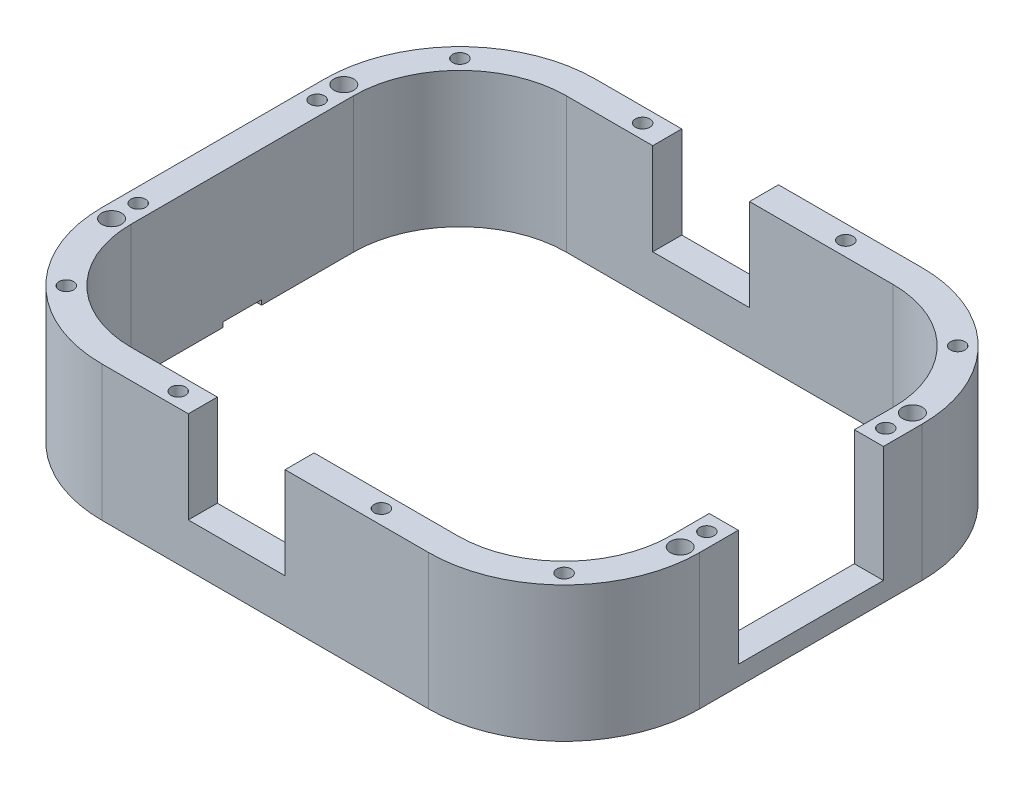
ISO-10303-21;
HEADER;
FILE_DESCRIPTION(('STEP AP214'),'2;1');
FILE_NAME('part.step','',(''),(''),'','','');
FILE_SCHEMA(('AUTOMOTIVE_DESIGN { 1 0 10303 214 1 1 1 1 }'));
ENDSEC;
DATA;
#1=APPLICATION_CONTEXT('core data for automotive mechanical design processes');
#2=APPLICATION_PROTOCOL_DEFINITION('international standard','automotive_design',2000,#1);
#3=PRODUCT_CONTEXT('',#1,'mechanical');
#4=PRODUCT('Part','Part','',(#3));
#5=PRODUCT_RELATED_PRODUCT_CATEGORY('part','',(#4));
#6=PRODUCT_DEFINITION_FORMATION('','',#4);
#7=PRODUCT_DEFINITION_CONTEXT('part definition',#1,'design');
#8=PRODUCT_DEFINITION('design','',#6,#7);
#9=PRODUCT_DEFINITION_SHAPE('','',#8);
#10=(LENGTH_UNIT() NAMED_UNIT(*) SI_UNIT(.MILLI.,.METRE.));
#11=(NAMED_UNIT(*) PLANE_ANGLE_UNIT() SI_UNIT($,.RADIAN.));
#12=(NAMED_UNIT(*) SI_UNIT($,.STERADIAN.) SOLID_ANGLE_UNIT());
#13=UNCERTAINTY_MEASURE_WITH_UNIT(LENGTH_MEASURE(1.E-05),#10,'distance_accuracy_value','');
#14=(GEOMETRIC_REPRESENTATION_CONTEXT(3) GLOBAL_UNCERTAINTY_ASSIGNED_CONTEXT((#13)) GLOBAL_UNIT_ASSIGNED_CONTEXT((#10,
#11,#12)) REPRESENTATION_CONTEXT('',''));
#15=CARTESIAN_POINT('',(0.,0.,0.));
#16=DIRECTION('',(0.,0.,1.));
#17=DIRECTION('',(1.,0.,0.));
#18=AXIS2_PLACEMENT_3D('',#15,#16,#17);
#19=CARTESIAN_POINT('',(0.,44.45,0.));
#20=DIRECTION('',(0.,1.,0.));
#21=DIRECTION('',(0.,0.,1.));
#22=AXIS2_PLACEMENT_3D('',#19,#20,#21);
#23=PLANE('',#22);
#24=CARTESIAN_POINT('',(208.530386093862,44.45,-76.2));
#25=DIRECTION('',(0.,1.,0.));
#26=DIRECTION('',(0.,0.,1.));
#27=AXIS2_PLACEMENT_3D('',#24,#25,#26);
#28=CIRCLE('',#27,6.50000000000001);
#29=CARTESIAN_POINT('',(208.530386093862,44.45,-69.7));
#30=VERTEX_POINT('',#29);
#31=EDGE_CURVE('E1128',#30,#30,#28,.T.);
#32=ORIENTED_EDGE('',*,*,#31,.F.);
#33=EDGE_LOOP('',(#32));
#34=FACE_BOUND('',#33,.T.);
#35=CARTESIAN_POINT('',(208.530386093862,44.45,-58.7375));
#36=DIRECTION('',(0.,1.,0.));
#37=DIRECTION('',(0.,0.,1.));
#38=AXIS2_PLACEMENT_3D('',#35,#36,#37);
#39=CIRCLE('',#38,4.7625);
#40=CARTESIAN_POINT('',(208.530386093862,44.45,-53.975));
#41=VERTEX_POINT('',#40);
#42=EDGE_CURVE('E383',#41,#41,#39,.T.);
#43=ORIENTED_EDGE('',*,*,#42,.F.);
#44=EDGE_LOOP('',(#43));
#45=FACE_BOUND('',#44,.T.);
#46=CARTESIAN_POINT('',(185.281986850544,44.45,-129.151600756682));
#47=DIRECTION('',(0.,1.,0.));
#48=DIRECTION('',(0.,0.,1.));
#49=AXIS2_PLACEMENT_3D('',#46,#47,#48);
#50=CIRCLE('',#49,4.7625);
#51=CARTESIAN_POINT('',(185.281986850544,44.45,-124.389100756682));
#52=VERTEX_POINT('',#51);
#53=EDGE_CURVE('E389',#52,#52,#50,.T.);
#54=ORIENTED_EDGE('',*,*,#53,.F.);
#55=EDGE_LOOP('',(#54));
#56=FACE_BOUND('',#55,.T.);
#57=CARTESIAN_POINT('',(88.6106360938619,44.45,-152.4));
#58=DIRECTION('',(0.,1.,0.));
#59=DIRECTION('',(0.,0.,1.));
#60=AXIS2_PLACEMENT_3D('',#57,#58,#59);
#61=CIRCLE('',#60,4.76250000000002);
#62=CARTESIAN_POINT('',(88.6106360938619,44.45,-147.6375));
#63=VERTEX_POINT('',#62);
#64=EDGE_CURVE('E397',#63,#63,#61,.T.);
#65=ORIENTED_EDGE('',*,*,#64,.F.);
#66=EDGE_LOOP('',(#65));
#67=FACE_BOUND('',#66,.T.);
#68=DIRECTION('',(1.,0.,0.));
#69=VECTOR('',#68,1.);
#70=CARTESIAN_POINT('',(199.005386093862,44.45,-47.625));
#71=LINE('',#70,#69);
#72=CARTESIAN_POINT('',(199.005386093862,44.45,-47.625));
#73=VERTEX_POINT('',#72);
#74=CARTESIAN_POINT('',(218.055386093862,44.45,-47.625));
#75=VERTEX_POINT('',#74);
#76=EDGE_CURVE('E425',#73,#75,#71,.T.);
#77=ORIENTED_EDGE('',*,*,#76,.T.);
#78=DIRECTION('',(0.,0.,-1.));
#79=VECTOR('',#78,1.);
#80=CARTESIAN_POINT('',(218.055386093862,44.45,73.025));
#81=LINE('',#80,#79);
#82=CARTESIAN_POINT('',(218.055386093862,44.45,-73.0249999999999));
#83=VERTEX_POINT('',#82);
#84=EDGE_CURVE('E584',#75,#83,#81,.T.);
#85=ORIENTED_EDGE('',*,*,#84,.T.);
#86=CARTESIAN_POINT('',(129.155386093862,44.45,-73.025));
#87=DIRECTION('',(0.,1.,0.));
#88=DIRECTION('',(0.,0.,1.));
#89=AXIS2_PLACEMENT_3D('',#86,#87,#88);
#90=CIRCLE('',#89,88.9);
#91=CARTESIAN_POINT('',(129.155386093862,44.45,-161.925));
#92=VERTEX_POINT('',#91);
#93=EDGE_CURVE('E588',#83,#92,#90,.T.);
#94=ORIENTED_EDGE('',*,*,#93,.T.);
#95=DIRECTION('',(-1.,0.,0.));
#96=VECTOR('',#95,1.);
#97=CARTESIAN_POINT('',(-85.2841139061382,44.45,-161.925));
#98=LINE('',#97,#96);
#99=CARTESIAN_POINT('',(34.925,44.45,-161.925));
#100=VERTEX_POINT('',#99);
#101=EDGE_CURVE('E593',#92,#100,#98,.T.);
#102=ORIENTED_EDGE('',*,*,#101,.T.);
#103=DIRECTION('',(0.,0.,1.));
#104=VECTOR('',#103,1.);
#105=CARTESIAN_POINT('',(34.925,44.45,161.925));
#106=LINE('',#105,#104);
#107=CARTESIAN_POINT('',(34.925,44.45,-142.875));
#108=VERTEX_POINT('',#107);
#109=EDGE_CURVE('E449',#100,#108,#106,.T.);
#110=ORIENTED_EDGE('',*,*,#109,.T.);
#111=DIRECTION('',(-1.,0.,0.));
#112=VECTOR('',#111,1.);
#113=CARTESIAN_POINT('',(-85.2841139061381,44.45,-142.875));
#114=LINE('',#113,#112);
#115=CARTESIAN_POINT('',(129.155386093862,44.45,-142.875));
#116=VERTEX_POINT('',#115);
#117=EDGE_CURVE('E513',#116,#108,#114,.T.);
#118=ORIENTED_EDGE('',*,*,#117,.F.);
#119=CARTESIAN_POINT('',(129.155386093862,44.45,-73.025));
#120=DIRECTION('',(0.,1.,0.));
#121=DIRECTION('',(0.,0.,1.));
#122=AXIS2_PLACEMENT_3D('',#119,#120,#121);
#123=CIRCLE('',#122,69.85);
#124=CARTESIAN_POINT('',(199.005386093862,44.45,-73.025));
#125=VERTEX_POINT('',#124);
#126=EDGE_CURVE('E509',#125,#116,#123,.T.);
#127=ORIENTED_EDGE('',*,*,#126,.F.);
#128=DIRECTION('',(0.,0.,-1.));
#129=VECTOR('',#128,1.);
#130=CARTESIAN_POINT('',(199.005386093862,44.45,73.0249999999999));
#131=LINE('',#130,#129);
#132=EDGE_CURVE('E505',#73,#125,#131,.T.);
#133=ORIENTED_EDGE('',*,*,#132,.F.);
#134=EDGE_LOOP('',(#77,#85,#94,#102,#110,#118,#127,#133));
#135=FACE_BOUND('',#134,.T.);
#136=ADVANCED_FACE('F42',(#34,#45,#56,#67,#135),#23,.T.);
#137=CARTESIAN_POINT('',(-85.2841139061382,-44.45,-161.925));
#138=DIRECTION('',(0.,0.,-1.));
#139=DIRECTION('',(-1.,0.,0.));
#140=AXIS2_PLACEMENT_3D('',#137,#138,#139);
#141=PLANE('',#140);
#142=DIRECTION('',(1.,0.,0.));
#143=VECTOR('',#142,1.);
#144=CARTESIAN_POINT('',(-28.575,-15.875,-161.925));
#145=LINE('',#144,#143);
#146=CARTESIAN_POINT('',(-28.575,-15.875,-161.925));
#147=VERTEX_POINT('',#146);
#148=CARTESIAN_POINT('',(34.925,-15.875,-161.925));
#149=VERTEX_POINT('',#148);
#150=EDGE_CURVE('E445',#147,#149,#145,.T.);
#151=ORIENTED_EDGE('',*,*,#150,.T.);
#152=DIRECTION('',(0.,1.,0.));
#153=VECTOR('',#152,1.);
#154=CARTESIAN_POINT('',(34.925,-15.875,-161.925));
#155=LINE('',#154,#153);
#156=EDGE_CURVE('E448',#149,#100,#155,.T.);
#157=ORIENTED_EDGE('',*,*,#156,.T.);
#158=ORIENTED_EDGE('',*,*,#101,.F.);
#159=DIRECTION('',(0.,1.,0.));
#160=VECTOR('',#159,1.);
#161=CARTESIAN_POINT('',(129.155386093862,-44.45,-161.925));
#162=LINE('',#161,#160);
#163=CARTESIAN_POINT('',(129.155386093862,-44.45,-161.925));
#164=VERTEX_POINT('',#163);
#165=EDGE_CURVE('E609',#164,#92,#162,.T.);
#166=ORIENTED_EDGE('',*,*,#165,.F.);
#167=DIRECTION('',(-1.,0.,0.));
#168=VECTOR('',#167,1.);
#169=CARTESIAN_POINT('',(-85.2841139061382,-44.45,-161.925));
#170=LINE('',#169,#168);
#171=CARTESIAN_POINT('',(-85.2841139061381,-44.45,-161.925));
#172=VERTEX_POINT('',#171);
#173=EDGE_CURVE('E565',#164,#172,#170,.T.);
#174=ORIENTED_EDGE('',*,*,#173,.T.);
#175=DIRECTION('',(0.,1.,0.));
#176=VECTOR('',#175,1.);
#177=CARTESIAN_POINT('',(-85.2841139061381,-44.45,-161.925));
#178=LINE('',#177,#176);
#179=CARTESIAN_POINT('',(-85.2841139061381,44.45,-161.925));
#180=VERTEX_POINT('',#179);
#181=EDGE_CURVE('E606',#172,#180,#178,.T.);
#182=ORIENTED_EDGE('',*,*,#181,.T.);
#183=CARTESIAN_POINT('',(-28.575,44.45,-161.925));
#184=VERTEX_POINT('',#183);
#185=EDGE_CURVE('E592',#184,#180,#98,.T.);
#186=ORIENTED_EDGE('',*,*,#185,.F.);
#187=DIRECTION('',(0.,1.,0.));
#188=VECTOR('',#187,1.);
#189=CARTESIAN_POINT('',(-28.575,-15.875,-161.925));
#190=LINE('',#189,#188);
#191=EDGE_CURVE('E458',#147,#184,#190,.T.);
#192=ORIENTED_EDGE('',*,*,#191,.F.);
#193=EDGE_LOOP('',(#151,#157,#158,#166,#174,#182,#186,#192));
#194=FACE_BOUND('',#193,.T.);
#195=ADVANCED_FACE('F686',(#194),#141,.T.);
#196=CARTESIAN_POINT('',(129.155386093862,-44.45,161.925));
#197=DIRECTION('',(0.,0.,1.));
#198=DIRECTION('',(1.,0.,0.));
#199=AXIS2_PLACEMENT_3D('',#196,#197,#198);
#200=PLANE('',#199);
#201=DIRECTION('',(1.,0.,0.));
#202=VECTOR('',#201,1.);
#203=CARTESIAN_POINT('',(129.155386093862,44.45,161.925));
#204=LINE('',#203,#202);
#205=CARTESIAN_POINT('',(34.925,44.45,161.925));
#206=VERTEX_POINT('',#205);
#207=CARTESIAN_POINT('',(129.155386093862,44.45,161.925));
#208=VERTEX_POINT('',#207);
#209=EDGE_CURVE('E577',#206,#208,#204,.T.);
#210=ORIENTED_EDGE('',*,*,#209,.F.);
#211=DIRECTION('',(0.,1.,0.));
#212=VECTOR('',#211,1.);
#213=CARTESIAN_POINT('',(34.925,-15.875,161.925));
#214=LINE('',#213,#212);
#215=CARTESIAN_POINT('',(34.925,-15.875,161.925));
#216=VERTEX_POINT('',#215);
#217=EDGE_CURVE('E463',#216,#206,#214,.T.);
#218=ORIENTED_EDGE('',*,*,#217,.F.);
#219=DIRECTION('',(-1.,0.,0.));
#220=VECTOR('',#219,1.);
#221=CARTESIAN_POINT('',(-28.575,-15.875,161.925));
#222=LINE('',#221,#220);
#223=CARTESIAN_POINT('',(-28.575,-15.875,161.925));
#224=VERTEX_POINT('',#223);
#225=EDGE_CURVE('E437',#216,#224,#222,.T.);
#226=ORIENTED_EDGE('',*,*,#225,.T.);
#227=DIRECTION('',(0.,1.,0.));
#228=VECTOR('',#227,1.);
#229=CARTESIAN_POINT('',(-28.575,-15.875,161.925));
#230=LINE('',#229,#228);
#231=CARTESIAN_POINT('',(-28.575,44.45,161.925));
#232=VERTEX_POINT('',#231);
#233=EDGE_CURVE('E460',#224,#232,#230,.T.);
#234=ORIENTED_EDGE('',*,*,#233,.T.);
#235=CARTESIAN_POINT('',(-85.2841139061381,44.45,161.925));
#236=VERTEX_POINT('',#235);
#237=EDGE_CURVE('E578',#236,#232,#204,.T.);
#238=ORIENTED_EDGE('',*,*,#237,.F.);
#239=DIRECTION('',(0.,1.,0.));
#240=VECTOR('',#239,1.);
#241=CARTESIAN_POINT('',(-85.2841139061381,-44.45,161.925));
#242=LINE('',#241,#240);
#243=CARTESIAN_POINT('',(-85.2841139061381,-44.45,161.925));
#244=VERTEX_POINT('',#243);
#245=EDGE_CURVE('E574',#244,#236,#242,.T.);
#246=ORIENTED_EDGE('',*,*,#245,.F.);
#247=DIRECTION('',(1.,0.,0.));
#248=VECTOR('',#247,1.);
#249=CARTESIAN_POINT('',(129.155386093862,-44.45,161.925));
#250=LINE('',#249,#248);
#251=CARTESIAN_POINT('',(129.155386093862,-44.45,161.925));
#252=VERTEX_POINT('',#251);
#253=EDGE_CURVE('E551',#244,#252,#250,.T.);
#254=ORIENTED_EDGE('',*,*,#253,.T.);
#255=DIRECTION('',(0.,1.,0.));
#256=VECTOR('',#255,1.);
#257=CARTESIAN_POINT('',(129.155386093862,-44.45,161.925));
#258=LINE('',#257,#256);
#259=EDGE_CURVE('E616',#252,#208,#258,.T.);
#260=ORIENTED_EDGE('',*,*,#259,.T.);
#261=EDGE_LOOP('',(#210,#218,#226,#234,#238,#246,#254,#260));
#262=FACE_BOUND('',#261,.T.);
#263=ADVANCED_FACE('F705',(#262),#200,.T.);
#264=CARTESIAN_POINT('',(208.530386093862,44.45,76.2000000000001));
#265=DIRECTION('',(0.,1.,0.));
#266=DIRECTION('',(0.,0.,1.));
#267=AXIS2_PLACEMENT_3D('',#264,#265,#266);
#268=CIRCLE('',#267,6.50000000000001);
#269=CARTESIAN_POINT('',(208.530386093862,44.45,82.7000000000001));
#270=VERTEX_POINT('',#269);
#271=EDGE_CURVE('E779',#270,#270,#268,.T.);
#272=ORIENTED_EDGE('',*,*,#271,.F.);
#273=EDGE_LOOP('',(#272));
#274=FACE_BOUND('',#273,.T.);
#275=CARTESIAN_POINT('',(88.6106360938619,44.45,152.4));
#276=DIRECTION('',(0.,1.,0.));
#277=DIRECTION('',(0.,0.,1.));
#278=AXIS2_PLACEMENT_3D('',#275,#276,#277);
#279=CIRCLE('',#278,4.76250000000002);
#280=CARTESIAN_POINT('',(88.6106360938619,44.45,157.1625));
#281=VERTEX_POINT('',#280);
#282=EDGE_CURVE('E365',#281,#281,#279,.T.);
#283=ORIENTED_EDGE('',*,*,#282,.F.);
#284=EDGE_LOOP('',(#283));
#285=FACE_BOUND('',#284,.T.);
#286=CARTESIAN_POINT('',(185.281986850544,44.45,129.151600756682));
#287=DIRECTION('',(0.,1.,0.));
#288=DIRECTION('',(0.,0.,1.));
#289=AXIS2_PLACEMENT_3D('',#286,#287,#288);
#290=CIRCLE('',#289,4.7625);
#291=CARTESIAN_POINT('',(185.281986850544,44.45,133.914100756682));
#292=VERTEX_POINT('',#291);
#293=EDGE_CURVE('E371',#292,#292,#290,.T.);
#294=ORIENTED_EDGE('',*,*,#293,.F.);
#295=EDGE_LOOP('',(#294));
#296=FACE_BOUND('',#295,.T.);
#297=CARTESIAN_POINT('',(208.530386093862,44.45,58.7375));
#298=DIRECTION('',(0.,1.,0.));
#299=DIRECTION('',(0.,0.,1.));
#300=AXIS2_PLACEMENT_3D('',#297,#298,#299);
#301=CIRCLE('',#300,4.7625);
#302=CARTESIAN_POINT('',(208.530386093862,44.45,63.5));
#303=VERTEX_POINT('',#302);
#304=EDGE_CURVE('E377',#303,#303,#301,.T.);
#305=ORIENTED_EDGE('',*,*,#304,.F.);
#306=EDGE_LOOP('',(#305));
#307=FACE_BOUND('',#306,.T.);
#308=DIRECTION('',(1.,0.,0.));
#309=VECTOR('',#308,1.);
#310=CARTESIAN_POINT('',(199.005386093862,44.45,47.625));
#311=LINE('',#310,#309);
#312=CARTESIAN_POINT('',(199.005386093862,44.45,47.625));
#313=VERTEX_POINT('',#312);
#314=CARTESIAN_POINT('',(218.055386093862,44.45,47.625));
#315=VERTEX_POINT('',#314);
#316=EDGE_CURVE('E418',#313,#315,#311,.T.);
#317=ORIENTED_EDGE('',*,*,#316,.F.);
#318=CARTESIAN_POINT('',(199.005386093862,44.45,73.0249999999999));
#319=VERTEX_POINT('',#318);
#320=EDGE_CURVE('E506',#319,#313,#131,.T.);
#321=ORIENTED_EDGE('',*,*,#320,.F.);
#322=CARTESIAN_POINT('',(129.155386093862,44.45,73.025));
#323=DIRECTION('',(0.,1.,0.));
#324=DIRECTION('',(0.,0.,1.));
#325=AXIS2_PLACEMENT_3D('',#322,#323,#324);
#326=CIRCLE('',#325,69.8500000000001);
#327=CARTESIAN_POINT('',(129.155386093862,44.45,142.875));
#328=VERTEX_POINT('',#327);
#329=EDGE_CURVE('E473',#328,#319,#326,.T.);
#330=ORIENTED_EDGE('',*,*,#329,.F.);
#331=DIRECTION('',(1.,0.,0.));
#332=VECTOR('',#331,1.);
#333=CARTESIAN_POINT('',(-85.2841139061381,44.45,142.875));
#334=LINE('',#333,#332);
#335=CARTESIAN_POINT('',(34.925,44.45,142.875));
#336=VERTEX_POINT('',#335);
#337=EDGE_CURVE('E525',#336,#328,#334,.T.);
#338=ORIENTED_EDGE('',*,*,#337,.F.);
#339=EDGE_CURVE('E428',#336,#206,#106,.T.);
#340=ORIENTED_EDGE('',*,*,#339,.T.);
#341=ORIENTED_EDGE('',*,*,#209,.T.);
#342=CARTESIAN_POINT('',(129.155386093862,44.45,73.025));
#343=DIRECTION('',(0.,1.,0.));
#344=DIRECTION('',(0.,0.,1.));
#345=AXIS2_PLACEMENT_3D('',#342,#343,#344);
#346=CIRCLE('',#345,88.9);
#347=CARTESIAN_POINT('',(218.055386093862,44.45,73.025));
#348=VERTEX_POINT('',#347);
#349=EDGE_CURVE('E581',#208,#348,#346,.T.);
#350=ORIENTED_EDGE('',*,*,#349,.T.);
#351=EDGE_CURVE('E585',#348,#315,#81,.T.);
#352=ORIENTED_EDGE('',*,*,#351,.T.);
#353=EDGE_LOOP('',(#317,#321,#330,#338,#340,#341,#350,#352));
#354=FACE_BOUND('',#353,.T.);
#355=ADVANCED_FACE('F719',(#274,#285,#296,#307,#354),#23,.T.);
#356=CARTESIAN_POINT('',(-164.659113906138,44.45,-76.2));
#357=DIRECTION('',(0.,1.,0.));
#358=DIRECTION('',(0.,0.,1.));
#359=AXIS2_PLACEMENT_3D('',#356,#357,#358);
#360=CIRCLE('',#359,6.50000000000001);
#361=CARTESIAN_POINT('',(-164.659113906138,44.45,-69.7));
#362=VERTEX_POINT('',#361);
#363=EDGE_CURVE('E1114',#362,#362,#360,.T.);
#364=ORIENTED_EDGE('',*,*,#363,.F.);
#365=EDGE_LOOP('',(#364));
#366=FACE_BOUND('',#365,.T.);
#367=CARTESIAN_POINT('',(-164.659113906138,44.45,76.2000000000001));
#368=DIRECTION('',(0.,1.,0.));
#369=DIRECTION('',(0.,0.,1.));
#370=AXIS2_PLACEMENT_3D('',#367,#368,#369);
#371=CIRCLE('',#370,6.50000000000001);
#372=CARTESIAN_POINT('',(-164.659113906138,44.45,82.7000000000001));
#373=VERTEX_POINT('',#372);
#374=EDGE_CURVE('E1116',#373,#373,#371,.T.);
#375=ORIENTED_EDGE('',*,*,#374,.F.);
#376=EDGE_LOOP('',(#375));
#377=FACE_BOUND('',#376,.T.);
#378=CARTESIAN_POINT('',(-44.7393639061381,44.45,152.4));
#379=DIRECTION('',(0.,1.,0.));
#380=DIRECTION('',(0.,0.,1.));
#381=AXIS2_PLACEMENT_3D('',#378,#379,#380);
#382=CIRCLE('',#381,4.76250000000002);
#383=CARTESIAN_POINT('',(-44.7393639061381,44.45,157.1625));
#384=VERTEX_POINT('',#383);
#385=EDGE_CURVE('E330',#384,#384,#382,.T.);
#386=ORIENTED_EDGE('',*,*,#385,.F.);
#387=EDGE_LOOP('',(#386));
#388=FACE_BOUND('',#387,.T.);
#389=CARTESIAN_POINT('',(-141.410714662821,44.45,-129.151600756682));
#390=DIRECTION('',(0.,1.,0.));
#391=DIRECTION('',(0.,0.,1.));
#392=AXIS2_PLACEMENT_3D('',#389,#390,#391);
#393=CIRCLE('',#392,4.7625);
#394=CARTESIAN_POINT('',(-141.410714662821,44.45,-124.389100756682));
#395=VERTEX_POINT('',#394);
#396=EDGE_CURVE('E341',#395,#395,#393,.T.);
#397=ORIENTED_EDGE('',*,*,#396,.F.);
#398=EDGE_LOOP('',(#397));
#399=FACE_BOUND('',#398,.T.);
#400=CARTESIAN_POINT('',(-164.659113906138,44.45,-58.7375));
#401=DIRECTION('',(0.,1.,0.));
#402=DIRECTION('',(0.,0.,1.));
#403=AXIS2_PLACEMENT_3D('',#400,#401,#402);
#404=CIRCLE('',#403,4.7625);
#405=CARTESIAN_POINT('',(-164.659113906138,44.45,-53.975));
#406=VERTEX_POINT('',#405);
#407=EDGE_CURVE('E347',#406,#406,#404,.T.);
#408=ORIENTED_EDGE('',*,*,#407,.F.);
#409=EDGE_LOOP('',(#408));
#410=FACE_BOUND('',#409,.T.);
#411=CARTESIAN_POINT('',(-141.410714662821,44.45,129.151600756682));
#412=DIRECTION('',(0.,1.,0.));
#413=DIRECTION('',(0.,0.,1.));
#414=AXIS2_PLACEMENT_3D('',#411,#412,#413);
#415=CIRCLE('',#414,4.7625);
#416=CARTESIAN_POINT('',(-141.410714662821,44.45,133.914100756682));
#417=VERTEX_POINT('',#416);
#418=EDGE_CURVE('E353',#417,#417,#415,.T.);
#419=ORIENTED_EDGE('',*,*,#418,.F.);
#420=EDGE_LOOP('',(#419));
#421=FACE_BOUND('',#420,.T.);
#422=CARTESIAN_POINT('',(-164.659113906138,44.45,58.7375));
#423=DIRECTION('',(0.,1.,0.));
#424=DIRECTION('',(0.,0.,1.));
#425=AXIS2_PLACEMENT_3D('',#422,#423,#424);
#426=CIRCLE('',#425,4.7625);
#427=CARTESIAN_POINT('',(-164.659113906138,44.45,63.5));
#428=VERTEX_POINT('',#427);
#429=EDGE_CURVE('E359',#428,#428,#426,.T.);
#430=ORIENTED_EDGE('',*,*,#429,.F.);
#431=EDGE_LOOP('',(#430));
#432=FACE_BOUND('',#431,.T.);
#433=CARTESIAN_POINT('',(-44.739363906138,44.45,-152.4));
#434=DIRECTION('',(0.,1.,0.));
#435=DIRECTION('',(0.,0.,1.));
#436=AXIS2_PLACEMENT_3D('',#433,#434,#435);
#437=CIRCLE('',#436,4.76250000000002);
#438=CARTESIAN_POINT('',(-44.739363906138,44.45,-147.6375));
#439=VERTEX_POINT('',#438);
#440=EDGE_CURVE('E403',#439,#439,#437,.T.);
#441=ORIENTED_EDGE('',*,*,#440,.F.);
#442=EDGE_LOOP('',(#441));
#443=FACE_BOUND('',#442,.T.);
#444=ORIENTED_EDGE('',*,*,#237,.T.);
#445=DIRECTION('',(0.,0.,-1.));
#446=VECTOR('',#445,1.);
#447=CARTESIAN_POINT('',(-28.575,44.45,161.925));
#448=LINE('',#447,#446);
#449=CARTESIAN_POINT('',(-28.575,44.45,142.875));
#450=VERTEX_POINT('',#449);
#451=EDGE_CURVE('E453',#232,#450,#448,.T.);
#452=ORIENTED_EDGE('',*,*,#451,.T.);
#453=CARTESIAN_POINT('',(-85.2841139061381,44.45,142.875));
#454=VERTEX_POINT('',#453);
#455=EDGE_CURVE('E478',#454,#450,#334,.T.);
#456=ORIENTED_EDGE('',*,*,#455,.F.);
#457=CARTESIAN_POINT('',(-85.2841139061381,44.45,73.025));
#458=DIRECTION('',(0.,1.,0.));
#459=DIRECTION('',(0.,0.,1.));
#460=AXIS2_PLACEMENT_3D('',#457,#458,#459);
#461=CIRCLE('',#460,69.8500000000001);
#462=CARTESIAN_POINT('',(-155.134113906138,44.45,73.025));
#463=VERTEX_POINT('',#462);
#464=EDGE_CURVE('E522',#463,#454,#461,.T.);
#465=ORIENTED_EDGE('',*,*,#464,.F.);
#466=DIRECTION('',(0.,0.,1.));
#467=VECTOR('',#466,1.);
#468=CARTESIAN_POINT('',(-155.134113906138,44.45,73.025));
#469=LINE('',#468,#467);
#470=CARTESIAN_POINT('',(-155.134113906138,44.45,-73.0249999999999));
#471=VERTEX_POINT('',#470);
#472=EDGE_CURVE('E519',#471,#463,#469,.T.);
#473=ORIENTED_EDGE('',*,*,#472,.F.);
#474=CARTESIAN_POINT('',(-85.2841139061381,44.45,-73.0249999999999));
#475=DIRECTION('',(0.,1.,0.));
#476=DIRECTION('',(0.,0.,1.));
#477=AXIS2_PLACEMENT_3D('',#474,#475,#476);
#478=CIRCLE('',#477,69.85);
#479=CARTESIAN_POINT('',(-85.2841139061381,44.45,-142.875));
#480=VERTEX_POINT('',#479);
#481=EDGE_CURVE('E516',#480,#471,#478,.T.);
#482=ORIENTED_EDGE('',*,*,#481,.F.);
#483=CARTESIAN_POINT('',(-28.575,44.45,-142.875));
#484=VERTEX_POINT('',#483);
#485=EDGE_CURVE('E512',#484,#480,#114,.T.);
#486=ORIENTED_EDGE('',*,*,#485,.F.);
#487=EDGE_CURVE('E452',#484,#184,#448,.T.);
#488=ORIENTED_EDGE('',*,*,#487,.T.);
#489=ORIENTED_EDGE('',*,*,#185,.T.);
#490=CARTESIAN_POINT('',(-85.2841139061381,44.45,-73.0249999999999));
#491=DIRECTION('',(0.,1.,0.));
#492=DIRECTION('',(0.,0.,1.));
#493=AXIS2_PLACEMENT_3D('',#490,#491,#492);
#494=CIRCLE('',#493,88.9);
#495=CARTESIAN_POINT('',(-174.184113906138,44.45,-73.0249999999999));
#496=VERTEX_POINT('',#495);
#497=EDGE_CURVE('E596',#180,#496,#494,.T.);
#498=ORIENTED_EDGE('',*,*,#497,.T.);
#499=DIRECTION('',(0.,0.,1.));
#500=VECTOR('',#499,1.);
#501=CARTESIAN_POINT('',(-174.184113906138,44.45,73.025));
#502=LINE('',#501,#500);
#503=CARTESIAN_POINT('',(-174.184113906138,44.45,73.025));
#504=VERTEX_POINT('',#503);
#505=EDGE_CURVE('E552',#496,#504,#502,.T.);
#506=ORIENTED_EDGE('',*,*,#505,.T.);
#507=CARTESIAN_POINT('',(-85.2841139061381,44.45,73.025));
#508=DIRECTION('',(0.,1.,0.));
#509=DIRECTION('',(0.,0.,1.));
#510=AXIS2_PLACEMENT_3D('',#507,#508,#509);
#511=CIRCLE('',#510,88.9);
#512=EDGE_CURVE('E531',#504,#236,#511,.T.);
#513=ORIENTED_EDGE('',*,*,#512,.T.);
#514=EDGE_LOOP('',(#444,#452,#456,#465,#473,#482,#486,#488,#489,#498,#506,#513));
#515=FACE_BOUND('',#514,.T.);
#516=ADVANCED_FACE('F655',(#366,#377,#388,#399,#410,#421,#432,#443,#515),#23,.T.);
#517=CARTESIAN_POINT('',(-85.2841139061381,-44.45,142.875));
#518=DIRECTION('',(0.,0.,1.));
#519=DIRECTION('',(1.,0.,0.));
#520=AXIS2_PLACEMENT_3D('',#517,#518,#519);
#521=PLANE('',#520);
#522=DIRECTION('',(0.,-1.,0.));
#523=VECTOR('',#522,1.);
#524=CARTESIAN_POINT('',(34.925,-44.45,142.875));
#525=LINE('',#524,#523);
#526=CARTESIAN_POINT('',(34.925,-15.875,142.875));
#527=VERTEX_POINT('',#526);
#528=EDGE_CURVE('E470',#336,#527,#525,.T.);
#529=ORIENTED_EDGE('',*,*,#528,.F.);
#530=ORIENTED_EDGE('',*,*,#337,.T.);
#531=DIRECTION('',(0.,1.,0.));
#532=VECTOR('',#531,1.);
#533=CARTESIAN_POINT('',(129.155386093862,-44.45,142.875));
#534=LINE('',#533,#532);
#535=CARTESIAN_POINT('',(129.155386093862,-44.45,142.875));
#536=VERTEX_POINT('',#535);
#537=EDGE_CURVE('E528',#536,#328,#534,.T.);
#538=ORIENTED_EDGE('',*,*,#537,.F.);
#539=DIRECTION('',(1.,0.,0.));
#540=VECTOR('',#539,1.);
#541=CARTESIAN_POINT('',(-85.2841139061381,-44.45,142.875));
#542=LINE('',#541,#540);
#543=CARTESIAN_POINT('',(-85.2841139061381,-44.45,142.875));
#544=VERTEX_POINT('',#543);
#545=EDGE_CURVE('E500',#544,#536,#542,.T.);
#546=ORIENTED_EDGE('',*,*,#545,.F.);
#547=DIRECTION('',(0.,1.,0.));
#548=VECTOR('',#547,1.);
#549=CARTESIAN_POINT('',(-85.2841139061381,-44.45,142.875));
#550=LINE('',#549,#548);
#551=EDGE_CURVE('E532',#544,#454,#550,.T.);
#552=ORIENTED_EDGE('',*,*,#551,.T.);
#553=ORIENTED_EDGE('',*,*,#455,.T.);
#554=DIRECTION('',(0.,1.,0.));
#555=VECTOR('',#554,1.);
#556=CARTESIAN_POINT('',(-28.575,-44.45,142.875));
#557=LINE('',#556,#555);
#558=CARTESIAN_POINT('',(-28.575,-15.875,142.875));
#559=VERTEX_POINT('',#558);
#560=EDGE_CURVE('E468',#559,#450,#557,.T.);
#561=ORIENTED_EDGE('',*,*,#560,.F.);
#562=DIRECTION('',(1.,0.,0.));
#563=VECTOR('',#562,1.);
#564=CARTESIAN_POINT('',(-85.2841139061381,-15.875,142.875));
#565=LINE('',#564,#563);
#566=EDGE_CURVE('E465',#559,#527,#565,.T.);
#567=ORIENTED_EDGE('',*,*,#566,.T.);
#568=EDGE_LOOP('',(#529,#530,#538,#546,#552,#553,#561,#567));
#569=FACE_BOUND('',#568,.T.);
#570=ADVANCED_FACE('F662',(#569),#521,.F.);
#571=CARTESIAN_POINT('',(-85.2841139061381,-44.45,-142.875));
#572=DIRECTION('',(0.,0.,-1.));
#573=DIRECTION('',(-1.,0.,0.));
#574=AXIS2_PLACEMENT_3D('',#571,#572,#573);
#575=PLANE('',#574);
#576=DIRECTION('',(0.,1.,0.));
#577=VECTOR('',#576,1.);
#578=CARTESIAN_POINT('',(34.925,-44.45,-142.875));
#579=LINE('',#578,#577);
#580=CARTESIAN_POINT('',(34.925,-15.875,-142.875));
#581=VERTEX_POINT('',#580);
#582=EDGE_CURVE('E625',#581,#108,#579,.T.);
#583=ORIENTED_EDGE('',*,*,#582,.F.);
#584=DIRECTION('',(-1.,0.,0.));
#585=VECTOR('',#584,1.);
#586=CARTESIAN_POINT('',(-85.2841139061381,-15.875,-142.875));
#587=LINE('',#586,#585);
#588=CARTESIAN_POINT('',(-28.575,-15.875,-142.875));
#589=VERTEX_POINT('',#588);
#590=EDGE_CURVE('E603',#581,#589,#587,.T.);
#591=ORIENTED_EDGE('',*,*,#590,.T.);
#592=DIRECTION('',(0.,-1.,0.));
#593=VECTOR('',#592,1.);
#594=CARTESIAN_POINT('',(-28.575,-44.45,-142.875));
#595=LINE('',#594,#593);
#596=EDGE_CURVE('E622',#484,#589,#595,.T.);
#597=ORIENTED_EDGE('',*,*,#596,.F.);
#598=ORIENTED_EDGE('',*,*,#485,.T.);
#599=DIRECTION('',(0.,1.,0.));
#600=VECTOR('',#599,1.);
#601=CARTESIAN_POINT('',(-85.2841139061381,-44.45,-142.875));
#602=LINE('',#601,#600);
#603=CARTESIAN_POINT('',(-85.2841139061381,-44.45,-142.875));
#604=VERTEX_POINT('',#603);
#605=EDGE_CURVE('E538',#604,#480,#602,.T.);
#606=ORIENTED_EDGE('',*,*,#605,.F.);
#607=DIRECTION('',(-1.,0.,0.));
#608=VECTOR('',#607,1.);
#609=CARTESIAN_POINT('',(-85.2841139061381,-44.45,-142.875));
#610=LINE('',#609,#608);
#611=CARTESIAN_POINT('',(129.155386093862,-44.45,-142.875));
#612=VERTEX_POINT('',#611);
#613=EDGE_CURVE('E485',#612,#604,#610,.T.);
#614=ORIENTED_EDGE('',*,*,#613,.F.);
#615=DIRECTION('',(0.,1.,0.));
#616=VECTOR('',#615,1.);
#617=CARTESIAN_POINT('',(129.155386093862,-44.45,-142.875));
#618=LINE('',#617,#616);
#619=EDGE_CURVE('E541',#612,#116,#618,.T.);
#620=ORIENTED_EDGE('',*,*,#619,.T.);
#621=ORIENTED_EDGE('',*,*,#117,.T.);
#622=EDGE_LOOP('',(#583,#591,#597,#598,#606,#614,#620,#621));
#623=FACE_BOUND('',#622,.T.);
#624=ADVANCED_FACE('F678',(#623),#575,.F.);
#625=CARTESIAN_POINT('',(0.,-44.45,0.));
#626=DIRECTION('',(0.,1.,0.));
#627=DIRECTION('',(0.,0.,1.));
#628=AXIS2_PLACEMENT_3D('',#625,#626,#627);
#629=PLANE('',#628);
#630=CARTESIAN_POINT('',(-164.659113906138,-44.45,-76.2));
#631=DIRECTION('',(0.,1.,0.));
#632=DIRECTION('',(0.,0.,1.));
#633=AXIS2_PLACEMENT_3D('',#630,#631,#632);
#634=CIRCLE('',#633,6.50000000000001);
#635=CARTESIAN_POINT('',(-164.659113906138,-44.45,-69.7));
#636=VERTEX_POINT('',#635);
#637=EDGE_CURVE('E1111',#636,#636,#634,.T.);
#638=ORIENTED_EDGE('',*,*,#637,.T.);
#639=EDGE_LOOP('',(#638));
#640=FACE_BOUND('',#639,.T.);
#641=CARTESIAN_POINT('',(-164.659113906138,-44.45,76.2000000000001));
#642=DIRECTION('',(0.,1.,0.));
#643=DIRECTION('',(0.,0.,1.));
#644=AXIS2_PLACEMENT_3D('',#641,#642,#643);
#645=CIRCLE('',#644,6.50000000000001);
#646=CARTESIAN_POINT('',(-164.659113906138,-44.45,82.7000000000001));
#647=VERTEX_POINT('',#646);
#648=EDGE_CURVE('E1121',#647,#647,#645,.T.);
#649=ORIENTED_EDGE('',*,*,#648,.T.);
#650=EDGE_LOOP('',(#649));
#651=FACE_BOUND('',#650,.T.);
#652=CARTESIAN_POINT('',(208.530386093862,-44.45,76.2000000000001));
#653=DIRECTION('',(0.,1.,0.));
#654=DIRECTION('',(0.,0.,1.));
#655=AXIS2_PLACEMENT_3D('',#652,#653,#654);
#656=CIRCLE('',#655,6.50000000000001);
#657=CARTESIAN_POINT('',(208.530386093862,-44.45,82.7000000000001));
#658=VERTEX_POINT('',#657);
#659=EDGE_CURVE('E1125',#658,#658,#656,.T.);
#660=ORIENTED_EDGE('',*,*,#659,.T.);
#661=EDGE_LOOP('',(#660));
#662=FACE_BOUND('',#661,.T.);
#663=CARTESIAN_POINT('',(208.530386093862,-44.45,-76.2));
#664=DIRECTION('',(0.,1.,0.));
#665=DIRECTION('',(0.,0.,1.));
#666=AXIS2_PLACEMENT_3D('',#663,#664,#665);
#667=CIRCLE('',#666,6.50000000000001);
#668=CARTESIAN_POINT('',(208.530386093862,-44.45,-69.7));
#669=VERTEX_POINT('',#668);
#670=EDGE_CURVE('E314',#669,#669,#667,.T.);
#671=ORIENTED_EDGE('',*,*,#670,.T.);
#672=EDGE_LOOP('',(#671));
#673=FACE_BOUND('',#672,.T.);
#674=CARTESIAN_POINT('',(-44.7393639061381,-44.45,152.4));
#675=DIRECTION('',(0.,1.,0.));
#676=DIRECTION('',(0.,0.,1.));
#677=AXIS2_PLACEMENT_3D('',#674,#675,#676);
#678=CIRCLE('',#677,4.7625);
#679=CARTESIAN_POINT('',(-44.7393639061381,-44.45,157.1625));
#680=VERTEX_POINT('',#679);
#681=EDGE_CURVE('E338',#680,#680,#678,.T.);
#682=ORIENTED_EDGE('',*,*,#681,.T.);
#683=EDGE_LOOP('',(#682));
#684=FACE_BOUND('',#683,.T.);
#685=CARTESIAN_POINT('',(-141.410714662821,-44.45,-129.151600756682));
#686=DIRECTION('',(0.,1.,0.));
#687=DIRECTION('',(0.,0.,1.));
#688=AXIS2_PLACEMENT_3D('',#685,#686,#687);
#689=CIRCLE('',#688,4.7625);
#690=CARTESIAN_POINT('',(-141.410714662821,-44.45,-124.389100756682));
#691=VERTEX_POINT('',#690);
#692=EDGE_CURVE('E344',#691,#691,#689,.T.);
#693=ORIENTED_EDGE('',*,*,#692,.T.);
#694=EDGE_LOOP('',(#693));
#695=FACE_BOUND('',#694,.T.);
#696=CARTESIAN_POINT('',(-164.659113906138,-44.45,-58.7375));
#697=DIRECTION('',(0.,1.,0.));
#698=DIRECTION('',(0.,0.,1.));
#699=AXIS2_PLACEMENT_3D('',#696,#697,#698);
#700=CIRCLE('',#699,4.7625);
#701=CARTESIAN_POINT('',(-164.659113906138,-44.45,-53.975));
#702=VERTEX_POINT('',#701);
#703=EDGE_CURVE('E350',#702,#702,#700,.T.);
#704=ORIENTED_EDGE('',*,*,#703,.T.);
#705=EDGE_LOOP('',(#704));
#706=FACE_BOUND('',#705,.T.);
#707=CARTESIAN_POINT('',(-141.410714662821,-44.45,129.151600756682));
#708=DIRECTION('',(0.,1.,0.));
#709=DIRECTION('',(0.,0.,1.));
#710=AXIS2_PLACEMENT_3D('',#707,#708,#709);
#711=CIRCLE('',#710,4.7625);
#712=CARTESIAN_POINT('',(-141.410714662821,-44.45,133.914100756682));
#713=VERTEX_POINT('',#712);
#714=EDGE_CURVE('E356',#713,#713,#711,.T.);
#715=ORIENTED_EDGE('',*,*,#714,.T.);
#716=EDGE_LOOP('',(#715));
#717=FACE_BOUND('',#716,.T.);
#718=CARTESIAN_POINT('',(-164.659113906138,-44.45,58.7375));
#719=DIRECTION('',(0.,1.,0.));
#720=DIRECTION('',(0.,0.,1.));
#721=AXIS2_PLACEMENT_3D('',#718,#719,#720);
#722=CIRCLE('',#721,4.7625);
#723=CARTESIAN_POINT('',(-164.659113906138,-44.45,63.5));
#724=VERTEX_POINT('',#723);
#725=EDGE_CURVE('E362',#724,#724,#722,.T.);
#726=ORIENTED_EDGE('',*,*,#725,.T.);
#727=EDGE_LOOP('',(#726));
#728=FACE_BOUND('',#727,.T.);
#729=CARTESIAN_POINT('',(88.6106360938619,-44.45,152.4));
#730=DIRECTION('',(0.,1.,0.));
#731=DIRECTION('',(0.,0.,1.));
#732=AXIS2_PLACEMENT_3D('',#729,#730,#731);
#733=CIRCLE('',#732,4.7625);
#734=CARTESIAN_POINT('',(88.6106360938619,-44.45,157.1625));
#735=VERTEX_POINT('',#734);
#736=EDGE_CURVE('E368',#735,#735,#733,.T.);
#737=ORIENTED_EDGE('',*,*,#736,.T.);
#738=EDGE_LOOP('',(#737));
#739=FACE_BOUND('',#738,.T.);
#740=CARTESIAN_POINT('',(185.281986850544,-44.45,129.151600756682));
#741=DIRECTION('',(0.,1.,0.));
#742=DIRECTION('',(0.,0.,1.));
#743=AXIS2_PLACEMENT_3D('',#740,#741,#742);
#744=CIRCLE('',#743,4.7625);
#745=CARTESIAN_POINT('',(185.281986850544,-44.45,133.914100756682));
#746=VERTEX_POINT('',#745);
#747=EDGE_CURVE('E374',#746,#746,#744,.T.);
#748=ORIENTED_EDGE('',*,*,#747,.T.);
#749=EDGE_LOOP('',(#748));
#750=FACE_BOUND('',#749,.T.);
#751=CARTESIAN_POINT('',(208.530386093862,-44.45,58.7375));
#752=DIRECTION('',(0.,1.,0.));
#753=DIRECTION('',(0.,0.,1.));
#754=AXIS2_PLACEMENT_3D('',#751,#752,#753);
#755=CIRCLE('',#754,4.7625);
#756=CARTESIAN_POINT('',(208.530386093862,-44.45,63.5));
#757=VERTEX_POINT('',#756);
#758=EDGE_CURVE('E380',#757,#757,#755,.T.);
#759=ORIENTED_EDGE('',*,*,#758,.T.);
#760=EDGE_LOOP('',(#759));
#761=FACE_BOUND('',#760,.T.);
#762=CARTESIAN_POINT('',(208.530386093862,-44.45,-58.7375));
#763=DIRECTION('',(0.,1.,0.));
#764=DIRECTION('',(0.,0.,1.));
#765=AXIS2_PLACEMENT_3D('',#762,#763,#764);
#766=CIRCLE('',#765,4.7625);
#767=CARTESIAN_POINT('',(208.530386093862,-44.45,-53.975));
#768=VERTEX_POINT('',#767);
#769=EDGE_CURVE('E386',#768,#768,#766,.T.);
#770=ORIENTED_EDGE('',*,*,#769,.T.);
#771=EDGE_LOOP('',(#770));
#772=FACE_BOUND('',#771,.T.);
#773=CARTESIAN_POINT('',(185.281986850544,-44.45,-129.151600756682));
#774=DIRECTION('',(0.,1.,0.));
#775=DIRECTION('',(0.,0.,1.));
#776=AXIS2_PLACEMENT_3D('',#773,#774,#775);
#777=CIRCLE('',#776,4.7625);
#778=CARTESIAN_POINT('',(185.281986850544,-44.45,-124.389100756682));
#779=VERTEX_POINT('',#778);
#780=EDGE_CURVE('E393',#779,#779,#777,.T.);
#781=ORIENTED_EDGE('',*,*,#780,.T.);
#782=EDGE_LOOP('',(#781));
#783=FACE_BOUND('',#782,.T.);
#784=CARTESIAN_POINT('',(88.6106360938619,-44.45,-152.4));
#785=DIRECTION('',(0.,1.,0.));
#786=DIRECTION('',(0.,0.,1.));
#787=AXIS2_PLACEMENT_3D('',#784,#785,#786);
#788=CIRCLE('',#787,4.7625);
#789=CARTESIAN_POINT('',(88.6106360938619,-44.45,-147.6375));
#790=VERTEX_POINT('',#789);
#791=EDGE_CURVE('E400',#790,#790,#788,.T.);
#792=ORIENTED_EDGE('',*,*,#791,.T.);
#793=EDGE_LOOP('',(#792));
#794=FACE_BOUND('',#793,.T.);
#795=CARTESIAN_POINT('',(-44.739363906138,-44.45,-152.4));
#796=DIRECTION('',(0.,1.,0.));
#797=DIRECTION('',(0.,0.,1.));
#798=AXIS2_PLACEMENT_3D('',#795,#796,#797);
#799=CIRCLE('',#798,4.7625);
#800=CARTESIAN_POINT('',(-44.739363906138,-44.45,-147.6375));
#801=VERTEX_POINT('',#800);
#802=EDGE_CURVE('E406',#801,#801,#799,.T.);
#803=ORIENTED_EDGE('',*,*,#802,.T.);
#804=EDGE_LOOP('',(#803));
#805=FACE_BOUND('',#804,.T.);
#806=DIRECTION('',(0.,0.,1.));
#807=VECTOR('',#806,1.);
#808=CARTESIAN_POINT('',(-155.134113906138,-44.45,73.025));
#809=LINE('',#808,#807);
#810=CARTESIAN_POINT('',(-155.134113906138,-44.45,-73.0249999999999));
#811=VERTEX_POINT('',#810);
#812=CARTESIAN_POINT('',(-155.134113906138,-44.45,-12.7));
#813=VERTEX_POINT('',#812);
#814=EDGE_CURVE('E493',#811,#813,#809,.T.);
#815=ORIENTED_EDGE('',*,*,#814,.T.);
#816=DIRECTION('',(1.,0.,0.));
#817=VECTOR('',#816,1.);
#818=CARTESIAN_POINT('',(-137.671613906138,-44.45,-12.7));
#819=LINE('',#818,#817);
#820=CARTESIAN_POINT('',(-156.721613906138,-44.45,-12.7));
#821=VERTEX_POINT('',#820);
#822=EDGE_CURVE('E285',#821,#813,#819,.T.);
#823=ORIENTED_EDGE('',*,*,#822,.F.);
#824=CARTESIAN_POINT('',(-156.721613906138,-44.45,-6.35));
#825=DIRECTION('',(0.,-1.,0.));
#826=DIRECTION('',(0.,0.,1.));
#827=AXIS2_PLACEMENT_3D('',#824,#825,#826);
#828=CIRCLE('',#827,6.35);
#829=CARTESIAN_POINT('',(-163.071613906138,-44.45,-6.35));
#830=VERTEX_POINT('',#829);
#831=EDGE_CURVE('E321',#830,#821,#828,.T.);
#832=ORIENTED_EDGE('',*,*,#831,.F.);
#833=DIRECTION('',(0.,0.,-1.));
#834=VECTOR('',#833,1.);
#835=CARTESIAN_POINT('',(-163.071613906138,-44.45,6.35));
#836=LINE('',#835,#834);
#837=CARTESIAN_POINT('',(-163.071613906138,-44.45,6.35));
#838=VERTEX_POINT('',#837);
#839=EDGE_CURVE('E317',#838,#830,#836,.T.);
#840=ORIENTED_EDGE('',*,*,#839,.F.);
#841=CARTESIAN_POINT('',(-156.721613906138,-44.45,6.35));
#842=DIRECTION('',(0.,-1.,0.));
#843=DIRECTION('',(0.,0.,1.));
#844=AXIS2_PLACEMENT_3D('',#841,#842,#843);
#845=CIRCLE('',#844,6.35);
#846=CARTESIAN_POINT('',(-156.721613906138,-44.45,12.7));
#847=VERTEX_POINT('',#846);
#848=EDGE_CURVE('E313',#847,#838,#845,.T.);
#849=ORIENTED_EDGE('',*,*,#848,.F.);
#850=DIRECTION('',(-1.,0.,0.));
#851=VECTOR('',#850,1.);
#852=CARTESIAN_POINT('',(-137.671613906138,-44.45,12.7));
#853=LINE('',#852,#851);
#854=CARTESIAN_POINT('',(-155.134113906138,-44.45,12.7));
#855=VERTEX_POINT('',#854);
#856=EDGE_CURVE('E291',#855,#847,#853,.T.);
#857=ORIENTED_EDGE('',*,*,#856,.F.);
#858=CARTESIAN_POINT('',(-155.134113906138,-44.45,73.025));
#859=VERTEX_POINT('',#858);
#860=EDGE_CURVE('E492',#855,#859,#809,.T.);
#861=ORIENTED_EDGE('',*,*,#860,.T.);
#862=CARTESIAN_POINT('',(-85.2841139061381,-44.45,73.025));
#863=DIRECTION('',(0.,1.,0.));
#864=DIRECTION('',(0.,0.,1.));
#865=AXIS2_PLACEMENT_3D('',#862,#863,#864);
#866=CIRCLE('',#865,69.8500000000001);
#867=EDGE_CURVE('E497',#859,#544,#866,.T.);
#868=ORIENTED_EDGE('',*,*,#867,.T.);
#869=ORIENTED_EDGE('',*,*,#545,.T.);
#870=CARTESIAN_POINT('',(129.155386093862,-44.45,73.025));
#871=DIRECTION('',(0.,1.,0.));
#872=DIRECTION('',(0.,0.,1.));
#873=AXIS2_PLACEMENT_3D('',#870,#871,#872);
#874=CIRCLE('',#873,69.8500000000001);
#875=CARTESIAN_POINT('',(199.005386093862,-44.45,73.0249999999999));
#876=VERTEX_POINT('',#875);
#877=EDGE_CURVE('E474',#536,#876,#874,.T.);
#878=ORIENTED_EDGE('',*,*,#877,.T.);
#879=DIRECTION('',(0.,0.,-1.));
#880=VECTOR('',#879,1.);
#881=CARTESIAN_POINT('',(199.005386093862,-44.45,73.0249999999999));
#882=LINE('',#881,#880);
#883=CARTESIAN_POINT('',(199.005386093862,-44.45,-73.025));
#884=VERTEX_POINT('',#883);
#885=EDGE_CURVE('E477',#876,#884,#882,.T.);
#886=ORIENTED_EDGE('',*,*,#885,.T.);
#887=CARTESIAN_POINT('',(129.155386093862,-44.45,-73.025));
#888=DIRECTION('',(0.,1.,0.));
#889=DIRECTION('',(0.,0.,1.));
#890=AXIS2_PLACEMENT_3D('',#887,#888,#889);
#891=CIRCLE('',#890,69.85);
#892=EDGE_CURVE('E481',#884,#612,#891,.T.);
#893=ORIENTED_EDGE('',*,*,#892,.T.);
#894=ORIENTED_EDGE('',*,*,#613,.T.);
#895=CARTESIAN_POINT('',(-85.2841139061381,-44.45,-73.0249999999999));
#896=DIRECTION('',(0.,1.,0.));
#897=DIRECTION('',(0.,0.,1.));
#898=AXIS2_PLACEMENT_3D('',#895,#896,#897);
#899=CIRCLE('',#898,69.85);
#900=EDGE_CURVE('E489',#604,#811,#899,.T.);
#901=ORIENTED_EDGE('',*,*,#900,.T.);
#902=EDGE_LOOP('',(#815,#823,#832,#840,#849,#857,#861,#868,#869,#878,#886,#893,#894,#901));
#903=FACE_BOUND('',#902,.T.);
#904=CARTESIAN_POINT('',(-85.2841139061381,-44.45,73.025));
#905=DIRECTION('',(0.,1.,0.));
#906=DIRECTION('',(0.,0.,1.));
#907=AXIS2_PLACEMENT_3D('',#904,#905,#906);
#908=CIRCLE('',#907,88.9);
#909=CARTESIAN_POINT('',(-174.184113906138,-44.45,73.025));
#910=VERTEX_POINT('',#909);
#911=EDGE_CURVE('E549',#910,#244,#908,.T.);
#912=ORIENTED_EDGE('',*,*,#911,.F.);
#913=DIRECTION('',(0.,0.,1.));
#914=VECTOR('',#913,1.);
#915=CARTESIAN_POINT('',(-174.184113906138,-44.45,73.025));
#916=LINE('',#915,#914);
#917=CARTESIAN_POINT('',(-174.184113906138,-44.45,-73.0249999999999));
#918=VERTEX_POINT('',#917);
#919=EDGE_CURVE('E571',#918,#910,#916,.T.);
#920=ORIENTED_EDGE('',*,*,#919,.F.);
#921=CARTESIAN_POINT('',(-85.2841139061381,-44.45,-73.0249999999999));
#922=DIRECTION('',(0.,1.,0.));
#923=DIRECTION('',(0.,0.,1.));
#924=AXIS2_PLACEMENT_3D('',#921,#922,#923);
#925=CIRCLE('',#924,88.9);
#926=EDGE_CURVE('E568',#172,#918,#925,.T.);
#927=ORIENTED_EDGE('',*,*,#926,.F.);
#928=ORIENTED_EDGE('',*,*,#173,.F.);
#929=CARTESIAN_POINT('',(129.155386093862,-44.45,-73.025));
#930=DIRECTION('',(0.,1.,0.));
#931=DIRECTION('',(0.,0.,1.));
#932=AXIS2_PLACEMENT_3D('',#929,#930,#931);
#933=CIRCLE('',#932,88.9);
#934=CARTESIAN_POINT('',(218.055386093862,-44.45,-73.0249999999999));
#935=VERTEX_POINT('',#934);
#936=EDGE_CURVE('E561',#935,#164,#933,.T.);
#937=ORIENTED_EDGE('',*,*,#936,.F.);
#938=DIRECTION('',(0.,0.,-1.));
#939=VECTOR('',#938,1.);
#940=CARTESIAN_POINT('',(218.055386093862,-44.45,73.025));
#941=LINE('',#940,#939);
#942=CARTESIAN_POINT('',(218.055386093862,-44.45,73.025));
#943=VERTEX_POINT('',#942);
#944=EDGE_CURVE('E558',#943,#935,#941,.T.);
#945=ORIENTED_EDGE('',*,*,#944,.F.);
#946=CARTESIAN_POINT('',(129.155386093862,-44.45,73.025));
#947=DIRECTION('',(0.,1.,0.));
#948=DIRECTION('',(0.,0.,1.));
#949=AXIS2_PLACEMENT_3D('',#946,#947,#948);
#950=CIRCLE('',#949,88.9);
#951=EDGE_CURVE('E555',#252,#943,#950,.T.);
#952=ORIENTED_EDGE('',*,*,#951,.F.);
#953=ORIENTED_EDGE('',*,*,#253,.F.);
#954=EDGE_LOOP('',(#912,#920,#927,#928,#937,#945,#952,#953));
#955=FACE_BOUND('',#954,.T.);
#956=ADVANCED_FACE('F44',(#640,#651,#662,#673,#684,#695,#706,#717,#728,#739,#750,#761,#772,#783,
#794,#805,#903,#955),#629,.F.);
#957=CARTESIAN_POINT('',(-85.2841139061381,-44.45,73.025));
#958=DIRECTION('',(0.,1.,0.));
#959=DIRECTION('',(0.,0.,1.));
#960=AXIS2_PLACEMENT_3D('',#957,#958,#959);
#961=CYLINDRICAL_SURFACE('',#960,88.9);
#962=ORIENTED_EDGE('',*,*,#512,.F.);
#963=DIRECTION('',(0.,1.,0.));
#964=VECTOR('',#963,1.);
#965=CARTESIAN_POINT('',(-174.184113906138,-44.45,73.025));
#966=LINE('',#965,#964);
#967=EDGE_CURVE('E601',#910,#504,#966,.T.);
#968=ORIENTED_EDGE('',*,*,#967,.F.);
#969=ORIENTED_EDGE('',*,*,#911,.T.);
#970=ORIENTED_EDGE('',*,*,#245,.T.);
#971=EDGE_LOOP('',(#962,#968,#969,#970));
#972=FACE_BOUND('',#971,.T.);
#973=ADVANCED_FACE('F699',(#972),#961,.T.);
#974=CARTESIAN_POINT('',(-174.184113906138,-44.45,73.025));
#975=DIRECTION('',(-1.,0.,0.));
#976=DIRECTION('',(0.,0.,1.));
#977=AXIS2_PLACEMENT_3D('',#974,#975,#976);
#978=PLANE('',#977);
#979=ORIENTED_EDGE('',*,*,#505,.F.);
#980=DIRECTION('',(0.,1.,0.));
#981=VECTOR('',#980,1.);
#982=CARTESIAN_POINT('',(-174.184113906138,-44.45,-73.0249999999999));
#983=LINE('',#982,#981);
#984=EDGE_CURVE('E604',#918,#496,#983,.T.);
#985=ORIENTED_EDGE('',*,*,#984,.F.);
#986=ORIENTED_EDGE('',*,*,#919,.T.);
#987=ORIENTED_EDGE('',*,*,#967,.T.);
#988=EDGE_LOOP('',(#979,#985,#986,#987));
#989=FACE_BOUND('',#988,.T.);
#990=ADVANCED_FACE('F695',(#989),#978,.T.);
#991=CARTESIAN_POINT('',(-85.2841139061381,-44.45,-73.0249999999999));
#992=DIRECTION('',(0.,1.,0.));
#993=DIRECTION('',(0.,0.,1.));
#994=AXIS2_PLACEMENT_3D('',#991,#992,#993);
#995=CYLINDRICAL_SURFACE('',#994,88.9);
#996=ORIENTED_EDGE('',*,*,#497,.F.);
#997=ORIENTED_EDGE('',*,*,#181,.F.);
#998=ORIENTED_EDGE('',*,*,#926,.T.);
#999=ORIENTED_EDGE('',*,*,#984,.T.);
#1000=EDGE_LOOP('',(#996,#997,#998,#999));
#1001=FACE_BOUND('',#1000,.T.);
#1002=ADVANCED_FACE('F691',(#1001),#995,.T.);
#1003=CARTESIAN_POINT('',(129.155386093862,-44.45,-73.025));
#1004=DIRECTION('',(0.,1.,0.));
#1005=DIRECTION('',(0.,0.,1.));
#1006=AXIS2_PLACEMENT_3D('',#1003,#1004,#1005);
#1007=CYLINDRICAL_SURFACE('',#1006,88.9);
#1008=ORIENTED_EDGE('',*,*,#93,.F.);
#1009=DIRECTION('',(0.,1.,0.));
#1010=VECTOR('',#1009,1.);
#1011=CARTESIAN_POINT('',(218.055386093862,-44.45,-73.0249999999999));
#1012=LINE('',#1011,#1010);
#1013=EDGE_CURVE('E611',#935,#83,#1012,.T.);
#1014=ORIENTED_EDGE('',*,*,#1013,.F.);
#1015=ORIENTED_EDGE('',*,*,#936,.T.);
#1016=ORIENTED_EDGE('',*,*,#165,.T.);
#1017=EDGE_LOOP('',(#1008,#1014,#1015,#1016));
#1018=FACE_BOUND('',#1017,.T.);
#1019=ADVANCED_FACE('F744',(#1018),#1007,.T.);
#1020=CARTESIAN_POINT('',(218.055386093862,-44.45,73.025));
#1021=DIRECTION('',(1.,0.,0.));
#1022=DIRECTION('',(0.,0.,-1.));
#1023=AXIS2_PLACEMENT_3D('',#1020,#1021,#1022);
#1024=PLANE('',#1023);
#1025=DIRECTION('',(0.,1.,0.));
#1026=VECTOR('',#1025,1.);
#1027=CARTESIAN_POINT('',(218.055386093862,44.45,-47.625));
#1028=LINE('',#1027,#1026);
#1029=CARTESIAN_POINT('',(218.055386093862,-31.75,-47.625));
#1030=VERTEX_POINT('',#1029);
#1031=EDGE_CURVE('E413',#1030,#75,#1028,.T.);
#1032=ORIENTED_EDGE('',*,*,#1031,.F.);
#1033=DIRECTION('',(0.,0.,-1.));
#1034=VECTOR('',#1033,1.);
#1035=CARTESIAN_POINT('',(218.055386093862,-31.75,47.625));
#1036=LINE('',#1035,#1034);
#1037=CARTESIAN_POINT('',(218.055386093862,-31.75,47.625));
#1038=VERTEX_POINT('',#1037);
#1039=EDGE_CURVE('E421',#1038,#1030,#1036,.T.);
#1040=ORIENTED_EDGE('',*,*,#1039,.F.);
#1041=DIRECTION('',(0.,-1.,0.));
#1042=VECTOR('',#1041,1.);
#1043=CARTESIAN_POINT('',(218.055386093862,44.45,47.625));
#1044=LINE('',#1043,#1042);
#1045=EDGE_CURVE('E409',#315,#1038,#1044,.T.);
#1046=ORIENTED_EDGE('',*,*,#1045,.F.);
#1047=ORIENTED_EDGE('',*,*,#351,.F.);
#1048=DIRECTION('',(0.,1.,0.));
#1049=VECTOR('',#1048,1.);
#1050=CARTESIAN_POINT('',(218.055386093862,-44.45,73.025));
#1051=LINE('',#1050,#1049);
#1052=EDGE_CURVE('E614',#943,#348,#1051,.T.);
#1053=ORIENTED_EDGE('',*,*,#1052,.F.);
#1054=ORIENTED_EDGE('',*,*,#944,.T.);
#1055=ORIENTED_EDGE('',*,*,#1013,.T.);
#1056=ORIENTED_EDGE('',*,*,#84,.F.);
#1057=EDGE_LOOP('',(#1032,#1040,#1046,#1047,#1053,#1054,#1055,#1056));
#1058=FACE_BOUND('',#1057,.T.);
#1059=ADVANCED_FACE('F730',(#1058),#1024,.T.);
#1060=CARTESIAN_POINT('',(129.155386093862,-44.45,73.025));
#1061=DIRECTION('',(0.,1.,0.));
#1062=DIRECTION('',(0.,0.,1.));
#1063=AXIS2_PLACEMENT_3D('',#1060,#1061,#1062);
#1064=CYLINDRICAL_SURFACE('',#1063,88.9);
#1065=ORIENTED_EDGE('',*,*,#349,.F.);
#1066=ORIENTED_EDGE('',*,*,#259,.F.);
#1067=ORIENTED_EDGE('',*,*,#951,.T.);
#1068=ORIENTED_EDGE('',*,*,#1052,.T.);
#1069=EDGE_LOOP('',(#1065,#1066,#1067,#1068));
#1070=FACE_BOUND('',#1069,.T.);
#1071=ADVANCED_FACE('F749',(#1070),#1064,.T.);
#1072=CARTESIAN_POINT('',(129.155386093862,-44.45,73.025));
#1073=DIRECTION('',(0.,1.,0.));
#1074=DIRECTION('',(0.,0.,1.));
#1075=AXIS2_PLACEMENT_3D('',#1072,#1073,#1074);
#1076=CYLINDRICAL_SURFACE('',#1075,69.8500000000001);
#1077=ORIENTED_EDGE('',*,*,#329,.T.);
#1078=DIRECTION('',(0.,1.,0.));
#1079=VECTOR('',#1078,1.);
#1080=CARTESIAN_POINT('',(199.005386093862,-44.45,73.0249999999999));
#1081=LINE('',#1080,#1079);
#1082=EDGE_CURVE('E503',#876,#319,#1081,.T.);
#1083=ORIENTED_EDGE('',*,*,#1082,.F.);
#1084=ORIENTED_EDGE('',*,*,#877,.F.);
#1085=ORIENTED_EDGE('',*,*,#537,.T.);
#1086=EDGE_LOOP('',(#1077,#1083,#1084,#1085));
#1087=FACE_BOUND('',#1086,.T.);
#1088=ADVANCED_FACE('F666',(#1087),#1076,.F.);
#1089=CARTESIAN_POINT('',(-85.2841139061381,-44.45,73.025));
#1090=DIRECTION('',(0.,1.,0.));
#1091=DIRECTION('',(0.,0.,1.));
#1092=AXIS2_PLACEMENT_3D('',#1089,#1090,#1091);
#1093=CYLINDRICAL_SURFACE('',#1092,69.8500000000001);
#1094=ORIENTED_EDGE('',*,*,#464,.T.);
#1095=ORIENTED_EDGE('',*,*,#551,.F.);
#1096=ORIENTED_EDGE('',*,*,#867,.F.);
#1097=DIRECTION('',(0.,1.,0.));
#1098=VECTOR('',#1097,1.);
#1099=CARTESIAN_POINT('',(-155.134113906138,-44.45,73.025));
#1100=LINE('',#1099,#1098);
#1101=EDGE_CURVE('E534',#859,#463,#1100,.T.);
#1102=ORIENTED_EDGE('',*,*,#1101,.T.);
#1103=EDGE_LOOP('',(#1094,#1095,#1096,#1102));
#1104=FACE_BOUND('',#1103,.T.);
#1105=ADVANCED_FACE('F657',(#1104),#1093,.F.);
#1106=CARTESIAN_POINT('',(-155.134113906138,-44.45,73.025));
#1107=DIRECTION('',(-1.,0.,0.));
#1108=DIRECTION('',(0.,0.,1.));
#1109=AXIS2_PLACEMENT_3D('',#1106,#1107,#1108);
#1110=PLANE('',#1109);
#1111=DIRECTION('',(0.,0.,-1.));
#1112=VECTOR('',#1111,1.);
#1113=CARTESIAN_POINT('',(-155.134113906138,-41.275,73.025));
#1114=LINE('',#1113,#1112);
#1115=CARTESIAN_POINT('',(-155.134113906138,-41.275,12.7));
#1116=VERTEX_POINT('',#1115);
#1117=CARTESIAN_POINT('',(-155.134113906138,-41.275,-12.7));
#1118=VERTEX_POINT('',#1117);
#1119=EDGE_CURVE('E281',#1116,#1118,#1114,.T.);
#1120=ORIENTED_EDGE('',*,*,#1119,.T.);
#1121=DIRECTION('',(0.,-1.,0.));
#1122=VECTOR('',#1121,1.);
#1123=CARTESIAN_POINT('',(-155.134113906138,-44.45,-12.7));
#1124=LINE('',#1123,#1122);
#1125=EDGE_CURVE('E12',#1118,#813,#1124,.T.);
#1126=ORIENTED_EDGE('',*,*,#1125,.T.);
#1127=ORIENTED_EDGE('',*,*,#814,.F.);
#1128=DIRECTION('',(0.,1.,0.));
#1129=VECTOR('',#1128,1.);
#1130=CARTESIAN_POINT('',(-155.134113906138,-44.45,-73.0249999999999));
#1131=LINE('',#1130,#1129);
#1132=EDGE_CURVE('E536',#811,#471,#1131,.T.);
#1133=ORIENTED_EDGE('',*,*,#1132,.T.);
#1134=ORIENTED_EDGE('',*,*,#472,.T.);
#1135=ORIENTED_EDGE('',*,*,#1101,.F.);
#1136=ORIENTED_EDGE('',*,*,#860,.F.);
#1137=DIRECTION('',(0.,1.,0.));
#1138=VECTOR('',#1137,1.);
#1139=CARTESIAN_POINT('',(-155.134113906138,-44.45,12.7));
#1140=LINE('',#1139,#1138);
#1141=EDGE_CURVE('E51',#855,#1116,#1140,.T.);
#1142=ORIENTED_EDGE('',*,*,#1141,.T.);
#1143=EDGE_LOOP('',(#1120,#1126,#1127,#1133,#1134,#1135,#1136,#1142));
#1144=FACE_BOUND('',#1143,.T.);
#1145=ADVANCED_FACE('F631',(#1144),#1110,.F.);
#1146=CARTESIAN_POINT('',(-85.2841139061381,-44.45,-73.0249999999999));
#1147=DIRECTION('',(0.,1.,0.));
#1148=DIRECTION('',(0.,0.,1.));
#1149=AXIS2_PLACEMENT_3D('',#1146,#1147,#1148);
#1150=CYLINDRICAL_SURFACE('',#1149,69.85);
#1151=ORIENTED_EDGE('',*,*,#481,.T.);
#1152=ORIENTED_EDGE('',*,*,#1132,.F.);
#1153=ORIENTED_EDGE('',*,*,#900,.F.);
#1154=ORIENTED_EDGE('',*,*,#605,.T.);
#1155=EDGE_LOOP('',(#1151,#1152,#1153,#1154));
#1156=FACE_BOUND('',#1155,.T.);
#1157=ADVANCED_FACE('F648',(#1156),#1150,.F.);
#1158=CARTESIAN_POINT('',(129.155386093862,-44.45,-73.025));
#1159=DIRECTION('',(0.,1.,0.));
#1160=DIRECTION('',(0.,0.,1.));
#1161=AXIS2_PLACEMENT_3D('',#1158,#1159,#1160);
#1162=CYLINDRICAL_SURFACE('',#1161,69.85);
#1163=ORIENTED_EDGE('',*,*,#126,.T.);
#1164=ORIENTED_EDGE('',*,*,#619,.F.);
#1165=ORIENTED_EDGE('',*,*,#892,.F.);
#1166=DIRECTION('',(0.,1.,0.));
#1167=VECTOR('',#1166,1.);
#1168=CARTESIAN_POINT('',(199.005386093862,-44.45,-73.025));
#1169=LINE('',#1168,#1167);
#1170=EDGE_CURVE('E544',#884,#125,#1169,.T.);
#1171=ORIENTED_EDGE('',*,*,#1170,.T.);
#1172=EDGE_LOOP('',(#1163,#1164,#1165,#1171));
#1173=FACE_BOUND('',#1172,.T.);
#1174=ADVANCED_FACE('F673',(#1173),#1162,.F.);
#1175=CARTESIAN_POINT('',(199.005386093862,-44.45,73.0249999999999));
#1176=DIRECTION('',(1.,0.,0.));
#1177=DIRECTION('',(0.,0.,-1.));
#1178=AXIS2_PLACEMENT_3D('',#1175,#1176,#1177);
#1179=PLANE('',#1178);
#1180=DIRECTION('',(0.,0.,-1.));
#1181=VECTOR('',#1180,1.);
#1182=CARTESIAN_POINT('',(199.005386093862,-31.75,47.625));
#1183=LINE('',#1182,#1181);
#1184=CARTESIAN_POINT('',(199.005386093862,-31.75,47.625));
#1185=VERTEX_POINT('',#1184);
#1186=CARTESIAN_POINT('',(199.005386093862,-31.75,-47.625));
#1187=VERTEX_POINT('',#1186);
#1188=EDGE_CURVE('E66',#1185,#1187,#1183,.T.);
#1189=ORIENTED_EDGE('',*,*,#1188,.T.);
#1190=DIRECTION('',(0.,1.,0.));
#1191=VECTOR('',#1190,1.);
#1192=CARTESIAN_POINT('',(199.005386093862,44.45,-47.625));
#1193=LINE('',#1192,#1191);
#1194=EDGE_CURVE('E415',#1187,#73,#1193,.T.);
#1195=ORIENTED_EDGE('',*,*,#1194,.T.);
#1196=ORIENTED_EDGE('',*,*,#132,.T.);
#1197=ORIENTED_EDGE('',*,*,#1170,.F.);
#1198=ORIENTED_EDGE('',*,*,#885,.F.);
#1199=ORIENTED_EDGE('',*,*,#1082,.T.);
#1200=ORIENTED_EDGE('',*,*,#320,.T.);
#1201=DIRECTION('',(0.,-1.,0.));
#1202=VECTOR('',#1201,1.);
#1203=CARTESIAN_POINT('',(199.005386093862,44.45,47.625));
#1204=LINE('',#1203,#1202);
#1205=EDGE_CURVE('E410',#313,#1185,#1204,.T.);
#1206=ORIENTED_EDGE('',*,*,#1205,.T.);
#1207=EDGE_LOOP('',(#1189,#1195,#1196,#1197,#1198,#1199,#1200,#1206));
#1208=FACE_BOUND('',#1207,.T.);
#1209=ADVANCED_FACE('F671',(#1208),#1179,.F.);
#1210=CARTESIAN_POINT('',(0.,-15.875,0.));
#1211=DIRECTION('',(0.,-1.,0.));
#1212=DIRECTION('',(0.,0.,-1.));
#1213=AXIS2_PLACEMENT_3D('',#1210,#1211,#1212);
#1214=PLANE('',#1213);
#1215=DIRECTION('',(0.,0.,1.));
#1216=VECTOR('',#1215,1.);
#1217=CARTESIAN_POINT('',(34.925,-15.875,161.925));
#1218=LINE('',#1217,#1216);
#1219=EDGE_CURVE('E434',#149,#581,#1218,.T.);
#1220=ORIENTED_EDGE('',*,*,#1219,.F.);
#1221=ORIENTED_EDGE('',*,*,#150,.F.);
#1222=DIRECTION('',(0.,0.,-1.));
#1223=VECTOR('',#1222,1.);
#1224=CARTESIAN_POINT('',(-28.575,-15.875,161.925));
#1225=LINE('',#1224,#1223);
#1226=EDGE_CURVE('E441',#589,#147,#1225,.T.);
#1227=ORIENTED_EDGE('',*,*,#1226,.F.);
#1228=ORIENTED_EDGE('',*,*,#590,.F.);
#1229=EDGE_LOOP('',(#1220,#1221,#1227,#1228));
#1230=FACE_BOUND('',#1229,.T.);
#1231=ADVANCED_FACE('F740',(#1230),#1214,.F.);
#1232=CARTESIAN_POINT('',(-28.575,-15.875,161.925));
#1233=DIRECTION('',(1.,0.,0.));
#1234=DIRECTION('',(0.,0.,-1.));
#1235=AXIS2_PLACEMENT_3D('',#1232,#1233,#1234);
#1236=PLANE('',#1235);
#1237=ORIENTED_EDGE('',*,*,#596,.T.);
#1238=ORIENTED_EDGE('',*,*,#1226,.T.);
#1239=ORIENTED_EDGE('',*,*,#191,.T.);
#1240=ORIENTED_EDGE('',*,*,#487,.F.);
#1241=EDGE_LOOP('',(#1237,#1238,#1239,#1240));
#1242=FACE_BOUND('',#1241,.T.);
#1243=ADVANCED_FACE('F826',(#1242),#1236,.T.);
#1244=CARTESIAN_POINT('',(34.925,-15.875,161.925));
#1245=DIRECTION('',(-1.,0.,0.));
#1246=DIRECTION('',(0.,0.,1.));
#1247=AXIS2_PLACEMENT_3D('',#1244,#1245,#1246);
#1248=PLANE('',#1247);
#1249=ORIENTED_EDGE('',*,*,#582,.T.);
#1250=ORIENTED_EDGE('',*,*,#109,.F.);
#1251=ORIENTED_EDGE('',*,*,#156,.F.);
#1252=ORIENTED_EDGE('',*,*,#1219,.T.);
#1253=EDGE_LOOP('',(#1249,#1250,#1251,#1252));
#1254=FACE_BOUND('',#1253,.T.);
#1255=ADVANCED_FACE('F736',(#1254),#1248,.T.);
#1256=ORIENTED_EDGE('',*,*,#528,.T.);
#1257=EDGE_CURVE('E438',#527,#216,#1218,.T.);
#1258=ORIENTED_EDGE('',*,*,#1257,.T.);
#1259=ORIENTED_EDGE('',*,*,#217,.T.);
#1260=ORIENTED_EDGE('',*,*,#339,.F.);
#1261=EDGE_LOOP('',(#1256,#1258,#1259,#1260));
#1262=FACE_BOUND('',#1261,.T.);
#1263=ADVANCED_FACE('F716',(#1262),#1248,.T.);
#1264=ORIENTED_EDGE('',*,*,#560,.T.);
#1265=ORIENTED_EDGE('',*,*,#451,.F.);
#1266=ORIENTED_EDGE('',*,*,#233,.F.);
#1267=EDGE_CURVE('E442',#224,#559,#1225,.T.);
#1268=ORIENTED_EDGE('',*,*,#1267,.T.);
#1269=EDGE_LOOP('',(#1264,#1265,#1266,#1268));
#1270=FACE_BOUND('',#1269,.T.);
#1271=ADVANCED_FACE('F708',(#1270),#1236,.T.);
#1272=ORIENTED_EDGE('',*,*,#1267,.F.);
#1273=ORIENTED_EDGE('',*,*,#225,.F.);
#1274=ORIENTED_EDGE('',*,*,#1257,.F.);
#1275=ORIENTED_EDGE('',*,*,#566,.F.);
#1276=EDGE_LOOP('',(#1272,#1273,#1274,#1275));
#1277=FACE_BOUND('',#1276,.T.);
#1278=ADVANCED_FACE('F712',(#1277),#1214,.F.);
#1279=CARTESIAN_POINT('',(199.005386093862,44.45,-47.625));
#1280=DIRECTION('',(0.,0.,-1.));
#1281=DIRECTION('',(-1.,0.,0.));
#1282=AXIS2_PLACEMENT_3D('',#1279,#1280,#1281);
#1283=PLANE('',#1282);
#1284=ORIENTED_EDGE('',*,*,#1031,.T.);
#1285=ORIENTED_EDGE('',*,*,#76,.F.);
#1286=ORIENTED_EDGE('',*,*,#1194,.F.);
#1287=DIRECTION('',(1.,0.,0.));
#1288=VECTOR('',#1287,1.);
#1289=CARTESIAN_POINT('',(199.005386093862,-31.75,-47.625));
#1290=LINE('',#1289,#1288);
#1291=EDGE_CURVE('E429',#1187,#1030,#1290,.T.);
#1292=ORIENTED_EDGE('',*,*,#1291,.T.);
#1293=EDGE_LOOP('',(#1284,#1285,#1286,#1292));
#1294=FACE_BOUND('',#1293,.T.);
#1295=ADVANCED_FACE('F732',(#1294),#1283,.F.);
#1296=CARTESIAN_POINT('',(199.005386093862,-31.75,47.625));
#1297=DIRECTION('',(0.,-1.,0.));
#1298=DIRECTION('',(0.,0.,-1.));
#1299=AXIS2_PLACEMENT_3D('',#1296,#1297,#1298);
#1300=PLANE('',#1299);
#1301=ORIENTED_EDGE('',*,*,#1039,.T.);
#1302=ORIENTED_EDGE('',*,*,#1291,.F.);
#1303=ORIENTED_EDGE('',*,*,#1188,.F.);
#1304=DIRECTION('',(1.,0.,0.));
#1305=VECTOR('',#1304,1.);
#1306=CARTESIAN_POINT('',(199.005386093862,-31.75,47.625));
#1307=LINE('',#1306,#1305);
#1308=EDGE_CURVE('E431',#1185,#1038,#1307,.T.);
#1309=ORIENTED_EDGE('',*,*,#1308,.T.);
#1310=EDGE_LOOP('',(#1301,#1302,#1303,#1309));
#1311=FACE_BOUND('',#1310,.T.);
#1312=ADVANCED_FACE('F725',(#1311),#1300,.F.);
#1313=CARTESIAN_POINT('',(199.005386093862,44.45,47.625));
#1314=DIRECTION('',(0.,0.,1.));
#1315=DIRECTION('',(1.,0.,0.));
#1316=AXIS2_PLACEMENT_3D('',#1313,#1314,#1315);
#1317=PLANE('',#1316);
#1318=ORIENTED_EDGE('',*,*,#1045,.T.);
#1319=ORIENTED_EDGE('',*,*,#1308,.F.);
#1320=ORIENTED_EDGE('',*,*,#1205,.F.);
#1321=ORIENTED_EDGE('',*,*,#316,.T.);
#1322=EDGE_LOOP('',(#1318,#1319,#1320,#1321));
#1323=FACE_BOUND('',#1322,.T.);
#1324=ADVANCED_FACE('F722',(#1323),#1317,.F.);
#1325=CARTESIAN_POINT('',(-44.739363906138,44.45,-152.4));
#1326=DIRECTION('',(0.,1.,0.));
#1327=DIRECTION('',(0.,0.,1.));
#1328=AXIS2_PLACEMENT_3D('',#1325,#1326,#1327);
#1329=CYLINDRICAL_SURFACE('',#1328,4.76250000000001);
#1330=ORIENTED_EDGE('',*,*,#802,.F.);
#1331=EDGE_LOOP('',(#1330));
#1332=FACE_BOUND('',#1331,.T.);
#1333=ORIENTED_EDGE('',*,*,#440,.T.);
#1334=EDGE_LOOP('',(#1333));
#1335=FACE_BOUND('',#1334,.T.);
#1336=ADVANCED_FACE('F811',(#1332,#1335),#1329,.F.);
#1337=CARTESIAN_POINT('',(88.6106360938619,44.45,-152.4));
#1338=DIRECTION('',(0.,1.,0.));
#1339=DIRECTION('',(0.,0.,1.));
#1340=AXIS2_PLACEMENT_3D('',#1337,#1338,#1339);
#1341=CYLINDRICAL_SURFACE('',#1340,4.76250000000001);
#1342=ORIENTED_EDGE('',*,*,#791,.F.);
#1343=EDGE_LOOP('',(#1342));
#1344=FACE_BOUND('',#1343,.T.);
#1345=ORIENTED_EDGE('',*,*,#64,.T.);
#1346=EDGE_LOOP('',(#1345));
#1347=FACE_BOUND('',#1346,.T.);
#1348=ADVANCED_FACE('F807',(#1344,#1347),#1341,.F.);
#1349=CARTESIAN_POINT('',(185.281986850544,44.45,-129.151600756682));
#1350=DIRECTION('',(0.,1.,0.));
#1351=DIRECTION('',(0.,0.,1.));
#1352=AXIS2_PLACEMENT_3D('',#1349,#1350,#1351);
#1353=CYLINDRICAL_SURFACE('',#1352,4.7625);
#1354=ORIENTED_EDGE('',*,*,#780,.F.);
#1355=EDGE_LOOP('',(#1354));
#1356=FACE_BOUND('',#1355,.T.);
#1357=ORIENTED_EDGE('',*,*,#53,.T.);
#1358=EDGE_LOOP('',(#1357));
#1359=FACE_BOUND('',#1358,.T.);
#1360=ADVANCED_FACE('F799',(#1356,#1359),#1353,.F.);
#1361=CARTESIAN_POINT('',(208.530386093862,44.45,-58.7375));
#1362=DIRECTION('',(0.,1.,0.));
#1363=DIRECTION('',(0.,0.,1.));
#1364=AXIS2_PLACEMENT_3D('',#1361,#1362,#1363);
#1365=CYLINDRICAL_SURFACE('',#1364,4.7625);
#1366=ORIENTED_EDGE('',*,*,#769,.F.);
#1367=EDGE_LOOP('',(#1366));
#1368=FACE_BOUND('',#1367,.T.);
#1369=ORIENTED_EDGE('',*,*,#42,.T.);
#1370=EDGE_LOOP('',(#1369));
#1371=FACE_BOUND('',#1370,.T.);
#1372=ADVANCED_FACE('F789',(#1368,#1371),#1365,.F.);
#1373=CARTESIAN_POINT('',(208.530386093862,44.45,58.7375));
#1374=DIRECTION('',(0.,1.,0.));
#1375=DIRECTION('',(0.,0.,1.));
#1376=AXIS2_PLACEMENT_3D('',#1373,#1374,#1375);
#1377=CYLINDRICAL_SURFACE('',#1376,4.7625);
#1378=ORIENTED_EDGE('',*,*,#758,.F.);
#1379=EDGE_LOOP('',(#1378));
#1380=FACE_BOUND('',#1379,.T.);
#1381=ORIENTED_EDGE('',*,*,#304,.T.);
#1382=EDGE_LOOP('',(#1381));
#1383=FACE_BOUND('',#1382,.T.);
#1384=ADVANCED_FACE('F786',(#1380,#1383),#1377,.F.);
#1385=CARTESIAN_POINT('',(185.281986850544,44.45,129.151600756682));
#1386=DIRECTION('',(0.,1.,0.));
#1387=DIRECTION('',(0.,0.,1.));
#1388=AXIS2_PLACEMENT_3D('',#1385,#1386,#1387);
#1389=CYLINDRICAL_SURFACE('',#1388,4.7625);
#1390=ORIENTED_EDGE('',*,*,#747,.F.);
#1391=EDGE_LOOP('',(#1390));
#1392=FACE_BOUND('',#1391,.T.);
#1393=ORIENTED_EDGE('',*,*,#293,.T.);
#1394=EDGE_LOOP('',(#1393));
#1395=FACE_BOUND('',#1394,.T.);
#1396=ADVANCED_FACE('F788',(#1392,#1395),#1389,.F.);
#1397=CARTESIAN_POINT('',(88.6106360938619,44.45,152.4));
#1398=DIRECTION('',(0.,1.,0.));
#1399=DIRECTION('',(0.,0.,1.));
#1400=AXIS2_PLACEMENT_3D('',#1397,#1398,#1399);
#1401=CYLINDRICAL_SURFACE('',#1400,4.76250000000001);
#1402=ORIENTED_EDGE('',*,*,#736,.F.);
#1403=EDGE_LOOP('',(#1402));
#1404=FACE_BOUND('',#1403,.T.);
#1405=ORIENTED_EDGE('',*,*,#282,.T.);
#1406=EDGE_LOOP('',(#1405));
#1407=FACE_BOUND('',#1406,.T.);
#1408=ADVANCED_FACE('F796',(#1404,#1407),#1401,.F.);
#1409=CARTESIAN_POINT('',(-164.659113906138,44.45,58.7375));
#1410=DIRECTION('',(0.,1.,0.));
#1411=DIRECTION('',(0.,0.,1.));
#1412=AXIS2_PLACEMENT_3D('',#1409,#1410,#1411);
#1413=CYLINDRICAL_SURFACE('',#1412,4.7625);
#1414=ORIENTED_EDGE('',*,*,#725,.F.);
#1415=EDGE_LOOP('',(#1414));
#1416=FACE_BOUND('',#1415,.T.);
#1417=ORIENTED_EDGE('',*,*,#429,.T.);
#1418=EDGE_LOOP('',(#1417));
#1419=FACE_BOUND('',#1418,.T.);
#1420=ADVANCED_FACE('F933',(#1416,#1419),#1413,.F.);
#1421=CARTESIAN_POINT('',(-141.410714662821,44.45,129.151600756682));
#1422=DIRECTION('',(0.,1.,0.));
#1423=DIRECTION('',(0.,0.,1.));
#1424=AXIS2_PLACEMENT_3D('',#1421,#1422,#1423);
#1425=CYLINDRICAL_SURFACE('',#1424,4.7625);
#1426=ORIENTED_EDGE('',*,*,#714,.F.);
#1427=EDGE_LOOP('',(#1426));
#1428=FACE_BOUND('',#1427,.T.);
#1429=ORIENTED_EDGE('',*,*,#418,.T.);
#1430=EDGE_LOOP('',(#1429));
#1431=FACE_BOUND('',#1430,.T.);
#1432=ADVANCED_FACE('F942',(#1428,#1431),#1425,.F.);
#1433=CARTESIAN_POINT('',(-164.659113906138,44.45,-58.7375));
#1434=DIRECTION('',(0.,1.,0.));
#1435=DIRECTION('',(0.,0.,1.));
#1436=AXIS2_PLACEMENT_3D('',#1433,#1434,#1435);
#1437=CYLINDRICAL_SURFACE('',#1436,4.7625);
#1438=ORIENTED_EDGE('',*,*,#703,.F.);
#1439=EDGE_LOOP('',(#1438));
#1440=FACE_BOUND('',#1439,.T.);
#1441=ORIENTED_EDGE('',*,*,#407,.T.);
#1442=EDGE_LOOP('',(#1441));
#1443=FACE_BOUND('',#1442,.T.);
#1444=ADVANCED_FACE('F952',(#1440,#1443),#1437,.F.);
#1445=CARTESIAN_POINT('',(-141.410714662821,44.45,-129.151600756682));
#1446=DIRECTION('',(0.,1.,0.));
#1447=DIRECTION('',(0.,0.,1.));
#1448=AXIS2_PLACEMENT_3D('',#1445,#1446,#1447);
#1449=CYLINDRICAL_SURFACE('',#1448,4.7625);
#1450=ORIENTED_EDGE('',*,*,#692,.F.);
#1451=EDGE_LOOP('',(#1450));
#1452=FACE_BOUND('',#1451,.T.);
#1453=ORIENTED_EDGE('',*,*,#396,.T.);
#1454=EDGE_LOOP('',(#1453));
#1455=FACE_BOUND('',#1454,.T.);
#1456=ADVANCED_FACE('F962',(#1452,#1455),#1449,.F.);
#1457=CARTESIAN_POINT('',(-44.7393639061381,44.45,152.4));
#1458=DIRECTION('',(0.,1.,0.));
#1459=DIRECTION('',(0.,0.,1.));
#1460=AXIS2_PLACEMENT_3D('',#1457,#1458,#1459);
#1461=CYLINDRICAL_SURFACE('',#1460,4.76250000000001);
#1462=ORIENTED_EDGE('',*,*,#681,.F.);
#1463=EDGE_LOOP('',(#1462));
#1464=FACE_BOUND('',#1463,.T.);
#1465=ORIENTED_EDGE('',*,*,#385,.T.);
#1466=EDGE_LOOP('',(#1465));
#1467=FACE_BOUND('',#1466,.T.);
#1468=ADVANCED_FACE('F972',(#1464,#1467),#1461,.F.);
#1469=CARTESIAN_POINT('',(-137.671613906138,-41.275,-12.7));
#1470=DIRECTION('',(0.,0.,-1.));
#1471=DIRECTION('',(-1.,0.,0.));
#1472=AXIS2_PLACEMENT_3D('',#1469,#1470,#1471);
#1473=PLANE('',#1472);
#1474=DIRECTION('',(1.,0.,0.));
#1475=VECTOR('',#1474,1.);
#1476=CARTESIAN_POINT('',(-137.671613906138,-41.275,-12.7));
#1477=LINE('',#1476,#1475);
#1478=CARTESIAN_POINT('',(-156.721613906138,-41.275,-12.7));
#1479=VERTEX_POINT('',#1478);
#1480=EDGE_CURVE('E58',#1479,#1118,#1477,.T.);
#1481=ORIENTED_EDGE('',*,*,#1480,.F.);
#1482=DIRECTION('',(0.,-1.,0.));
#1483=VECTOR('',#1482,1.);
#1484=CARTESIAN_POINT('',(-156.721613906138,-41.275,-12.7));
#1485=LINE('',#1484,#1483);
#1486=EDGE_CURVE('E327',#1479,#821,#1485,.T.);
#1487=ORIENTED_EDGE('',*,*,#1486,.T.);
#1488=ORIENTED_EDGE('',*,*,#822,.T.);
#1489=ORIENTED_EDGE('',*,*,#1125,.F.);
#1490=EDGE_LOOP('',(#1481,#1487,#1488,#1489));
#1491=FACE_BOUND('',#1490,.T.);
#1492=ADVANCED_FACE('F643',(#1491),#1473,.F.);
#1493=CARTESIAN_POINT('',(-137.671613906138,-41.275,12.7));
#1494=DIRECTION('',(0.,0.,1.));
#1495=DIRECTION('',(1.,0.,0.));
#1496=AXIS2_PLACEMENT_3D('',#1493,#1494,#1495);
#1497=PLANE('',#1496);
#1498=ORIENTED_EDGE('',*,*,#856,.T.);
#1499=DIRECTION('',(0.,-1.,0.));
#1500=VECTOR('',#1499,1.);
#1501=CARTESIAN_POINT('',(-156.721613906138,-41.275,12.7));
#1502=LINE('',#1501,#1500);
#1503=CARTESIAN_POINT('',(-156.721613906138,-41.275,12.7));
#1504=VERTEX_POINT('',#1503);
#1505=EDGE_CURVE('E288',#1504,#847,#1502,.T.);
#1506=ORIENTED_EDGE('',*,*,#1505,.F.);
#1507=DIRECTION('',(-1.,0.,0.));
#1508=VECTOR('',#1507,1.);
#1509=CARTESIAN_POINT('',(-137.671613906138,-41.275,12.7));
#1510=LINE('',#1509,#1508);
#1511=EDGE_CURVE('E274',#1116,#1504,#1510,.T.);
#1512=ORIENTED_EDGE('',*,*,#1511,.F.);
#1513=ORIENTED_EDGE('',*,*,#1141,.F.);
#1514=EDGE_LOOP('',(#1498,#1506,#1512,#1513));
#1515=FACE_BOUND('',#1514,.T.);
#1516=ADVANCED_FACE('F289',(#1515),#1497,.F.);
#1517=CARTESIAN_POINT('',(-156.721613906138,-41.275,-6.35));
#1518=DIRECTION('',(0.,1.,0.));
#1519=DIRECTION('',(0.,0.,1.));
#1520=AXIS2_PLACEMENT_3D('',#1517,#1518,#1519);
#1521=PLANE('',#1520);
#1522=ORIENTED_EDGE('',*,*,#1511,.T.);
#1523=CARTESIAN_POINT('',(-156.721613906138,-41.275,6.35));
#1524=DIRECTION('',(0.,-1.,0.));
#1525=DIRECTION('',(0.,0.,1.));
#1526=AXIS2_PLACEMENT_3D('',#1523,#1524,#1525);
#1527=CIRCLE('',#1526,6.35);
#1528=CARTESIAN_POINT('',(-163.071613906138,-41.275,6.35));
#1529=VERTEX_POINT('',#1528);
#1530=EDGE_CURVE('E279',#1504,#1529,#1527,.T.);
#1531=ORIENTED_EDGE('',*,*,#1530,.T.);
#1532=DIRECTION('',(0.,0.,-1.));
#1533=VECTOR('',#1532,1.);
#1534=CARTESIAN_POINT('',(-163.071613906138,-41.275,6.35));
#1535=LINE('',#1534,#1533);
#1536=CARTESIAN_POINT('',(-163.071613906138,-41.275,-6.35));
#1537=VERTEX_POINT('',#1536);
#1538=EDGE_CURVE('E301',#1529,#1537,#1535,.T.);
#1539=ORIENTED_EDGE('',*,*,#1538,.T.);
#1540=CARTESIAN_POINT('',(-156.721613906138,-41.275,-6.35));
#1541=DIRECTION('',(0.,-1.,0.));
#1542=DIRECTION('',(0.,0.,1.));
#1543=AXIS2_PLACEMENT_3D('',#1540,#1541,#1542);
#1544=CIRCLE('',#1543,6.35);
#1545=EDGE_CURVE('E305',#1537,#1479,#1544,.T.);
#1546=ORIENTED_EDGE('',*,*,#1545,.T.);
#1547=ORIENTED_EDGE('',*,*,#1480,.T.);
#1548=ORIENTED_EDGE('',*,*,#1119,.F.);
#1549=EDGE_LOOP('',(#1522,#1531,#1539,#1546,#1547,#1548));
#1550=FACE_BOUND('',#1549,.T.);
#1551=ADVANCED_FACE('F276',(#1550),#1521,.F.);
#1552=CARTESIAN_POINT('',(-156.721613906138,-41.275,-6.35));
#1553=DIRECTION('',(0.,-1.,0.));
#1554=DIRECTION('',(0.,0.,-1.));
#1555=AXIS2_PLACEMENT_3D('',#1552,#1553,#1554);
#1556=CYLINDRICAL_SURFACE('',#1555,6.35);
#1557=ORIENTED_EDGE('',*,*,#831,.T.);
#1558=ORIENTED_EDGE('',*,*,#1486,.F.);
#1559=ORIENTED_EDGE('',*,*,#1545,.F.);
#1560=DIRECTION('',(0.,-1.,0.));
#1561=VECTOR('',#1560,1.);
#1562=CARTESIAN_POINT('',(-163.071613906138,-41.275,-6.35));
#1563=LINE('',#1562,#1561);
#1564=EDGE_CURVE('E331',#1537,#830,#1563,.T.);
#1565=ORIENTED_EDGE('',*,*,#1564,.T.);
#1566=EDGE_LOOP('',(#1557,#1558,#1559,#1565));
#1567=FACE_BOUND('',#1566,.T.);
#1568=ADVANCED_FACE('F1015',(#1567),#1556,.F.);
#1569=CARTESIAN_POINT('',(-163.071613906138,-41.275,6.35));
#1570=DIRECTION('',(-1.,0.,0.));
#1571=DIRECTION('',(0.,0.,1.));
#1572=AXIS2_PLACEMENT_3D('',#1569,#1570,#1571);
#1573=PLANE('',#1572);
#1574=ORIENTED_EDGE('',*,*,#839,.T.);
#1575=ORIENTED_EDGE('',*,*,#1564,.F.);
#1576=ORIENTED_EDGE('',*,*,#1538,.F.);
#1577=DIRECTION('',(0.,-1.,0.));
#1578=VECTOR('',#1577,1.);
#1579=CARTESIAN_POINT('',(-163.071613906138,-41.275,6.35));
#1580=LINE('',#1579,#1578);
#1581=EDGE_CURVE('E296',#1529,#838,#1580,.T.);
#1582=ORIENTED_EDGE('',*,*,#1581,.T.);
#1583=EDGE_LOOP('',(#1574,#1575,#1576,#1582));
#1584=FACE_BOUND('',#1583,.T.);
#1585=ADVANCED_FACE('F639',(#1584),#1573,.F.);
#1586=CARTESIAN_POINT('',(-156.721613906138,-41.275,6.35));
#1587=DIRECTION('',(0.,-1.,0.));
#1588=DIRECTION('',(0.,0.,-1.));
#1589=AXIS2_PLACEMENT_3D('',#1586,#1587,#1588);
#1590=CYLINDRICAL_SURFACE('',#1589,6.35);
#1591=ORIENTED_EDGE('',*,*,#848,.T.);
#1592=ORIENTED_EDGE('',*,*,#1581,.F.);
#1593=ORIENTED_EDGE('',*,*,#1530,.F.);
#1594=ORIENTED_EDGE('',*,*,#1505,.T.);
#1595=EDGE_LOOP('',(#1591,#1592,#1593,#1594));
#1596=FACE_BOUND('',#1595,.T.);
#1597=ADVANCED_FACE('F298',(#1596),#1590,.F.);
#1598=CARTESIAN_POINT('',(208.530386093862,44.45,-76.2));
#1599=DIRECTION('',(0.,1.,0.));
#1600=DIRECTION('',(0.,0.,1.));
#1601=AXIS2_PLACEMENT_3D('',#1598,#1599,#1600);
#1602=CYLINDRICAL_SURFACE('',#1601,6.50000000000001);
#1603=ORIENTED_EDGE('',*,*,#670,.F.);
#1604=EDGE_LOOP('',(#1603));
#1605=FACE_BOUND('',#1604,.T.);
#1606=ORIENTED_EDGE('',*,*,#31,.T.);
#1607=EDGE_LOOP('',(#1606));
#1608=FACE_BOUND('',#1607,.T.);
#1609=ADVANCED_FACE('F1039',(#1605,#1608),#1602,.F.);
#1610=CARTESIAN_POINT('',(208.530386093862,44.45,76.2000000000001));
#1611=DIRECTION('',(0.,1.,0.));
#1612=DIRECTION('',(0.,0.,1.));
#1613=AXIS2_PLACEMENT_3D('',#1610,#1611,#1612);
#1614=CYLINDRICAL_SURFACE('',#1613,6.50000000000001);
#1615=ORIENTED_EDGE('',*,*,#659,.F.);
#1616=EDGE_LOOP('',(#1615));
#1617=FACE_BOUND('',#1616,.T.);
#1618=ORIENTED_EDGE('',*,*,#271,.T.);
#1619=EDGE_LOOP('',(#1618));
#1620=FACE_BOUND('',#1619,.T.);
#1621=ADVANCED_FACE('F1074',(#1617,#1620),#1614,.F.);
#1622=CARTESIAN_POINT('',(-164.659113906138,44.45,76.2000000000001));
#1623=DIRECTION('',(0.,1.,0.));
#1624=DIRECTION('',(0.,0.,1.));
#1625=AXIS2_PLACEMENT_3D('',#1622,#1623,#1624);
#1626=CYLINDRICAL_SURFACE('',#1625,6.50000000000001);
#1627=ORIENTED_EDGE('',*,*,#648,.F.);
#1628=EDGE_LOOP('',(#1627));
#1629=FACE_BOUND('',#1628,.T.);
#1630=ORIENTED_EDGE('',*,*,#374,.T.);
#1631=EDGE_LOOP('',(#1630));
#1632=FACE_BOUND('',#1631,.T.);
#1633=ADVANCED_FACE('F1084',(#1629,#1632),#1626,.F.);
#1634=CARTESIAN_POINT('',(-164.659113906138,44.45,-76.2));
#1635=DIRECTION('',(0.,1.,0.));
#1636=DIRECTION('',(0.,0.,1.));
#1637=AXIS2_PLACEMENT_3D('',#1634,#1635,#1636);
#1638=CYLINDRICAL_SURFACE('',#1637,6.50000000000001);
#1639=ORIENTED_EDGE('',*,*,#637,.F.);
#1640=EDGE_LOOP('',(#1639));
#1641=FACE_BOUND('',#1640,.T.);
#1642=ORIENTED_EDGE('',*,*,#363,.T.);
#1643=EDGE_LOOP('',(#1642));
#1644=FACE_BOUND('',#1643,.T.);
#1645=ADVANCED_FACE('F1094',(#1641,#1644),#1638,.F.);
#1646=CLOSED_SHELL('',(#136,#195,#263,#355,#516,#570,#624,#956,#973,#990,#1002,#1019,#1059,
#1071,#1088,#1105,#1145,#1157,#1174,#1209,#1231,#1243,#1255,#1263,#1271,#1278,#1295,#1312,#1324,
#1336,#1348,#1360,#1372,#1384,#1396,#1408,#1420,#1432,#1444,#1456,#1468,#1492,#1516,#1551,#1568,
#1585,#1597,#1609,#1621,#1633,#1645));
#1647=MANIFOLD_SOLID_BREP('B2',#1646);
#1648=ADVANCED_BREP_SHAPE_REPRESENTATION('',(#18,#1647),#14);
#1649=SHAPE_DEFINITION_REPRESENTATION(#9,#1648);
ENDSEC;
END-ISO-10303-21;
